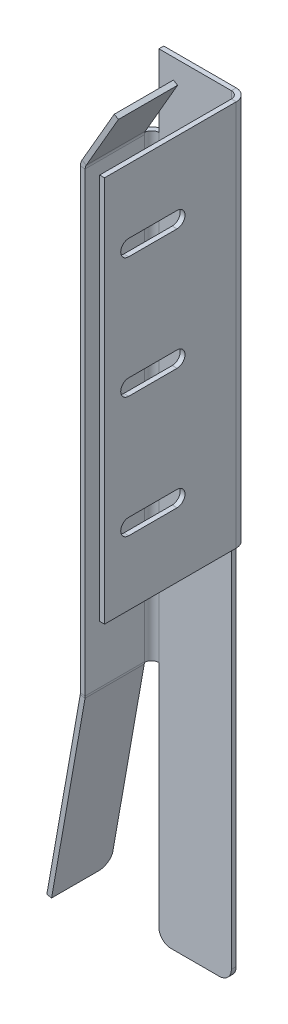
ISO-10303-21;
HEADER;
FILE_DESCRIPTION(('STEP AP214'),'2;1');
FILE_NAME('part.step','',(''),(''),'','','');
FILE_SCHEMA(('AUTOMOTIVE_DESIGN { 1 0 10303 214 1 1 1 1 }'));
ENDSEC;
DATA;
#1=APPLICATION_CONTEXT('core data for automotive mechanical design processes');
#2=APPLICATION_PROTOCOL_DEFINITION('international standard','automotive_design',2000,#1);
#3=PRODUCT_CONTEXT('',#1,'mechanical');
#4=PRODUCT('Part','Part','',(#3));
#5=PRODUCT_RELATED_PRODUCT_CATEGORY('part','',(#4));
#6=PRODUCT_DEFINITION_FORMATION('','',#4);
#7=PRODUCT_DEFINITION_CONTEXT('part definition',#1,'design');
#8=PRODUCT_DEFINITION('design','',#6,#7);
#9=PRODUCT_DEFINITION_SHAPE('','',#8);
#10=(LENGTH_UNIT() NAMED_UNIT(*) SI_UNIT(.MILLI.,.METRE.));
#11=(NAMED_UNIT(*) PLANE_ANGLE_UNIT() SI_UNIT($,.RADIAN.));
#12=(NAMED_UNIT(*) SI_UNIT($,.STERADIAN.) SOLID_ANGLE_UNIT());
#13=UNCERTAINTY_MEASURE_WITH_UNIT(LENGTH_MEASURE(1.E-05),#10,'distance_accuracy_value','');
#14=(GEOMETRIC_REPRESENTATION_CONTEXT(3) GLOBAL_UNCERTAINTY_ASSIGNED_CONTEXT((#13)) GLOBAL_UNIT_ASSIGNED_CONTEXT((#10,
#11,#12)) REPRESENTATION_CONTEXT('',''));
#15=CARTESIAN_POINT('',(0.,0.,0.));
#16=DIRECTION('',(0.,0.,1.));
#17=DIRECTION('',(1.,0.,0.));
#18=AXIS2_PLACEMENT_3D('',#15,#16,#17);
#19=CARTESIAN_POINT('',(-18.,129.196152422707,4.99999999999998));
#20=DIRECTION('',(0.,0.,1.));
#21=DIRECTION('',(1.,0.,0.));
#22=AXIS2_PLACEMENT_3D('',#19,#20,#21);
#23=PLANE('',#22);
#24=DIRECTION('',(0.,-1.,0.));
#25=VECTOR('',#24,1.);
#26=CARTESIAN_POINT('',(-20.,-60.,4.99999999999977));
#27=LINE('',#26,#25);
#28=CARTESIAN_POINT('',(-20.,129.196152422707,4.99999999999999));
#29=VERTEX_POINT('',#28);
#30=CARTESIAN_POINT('',(-20.0000000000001,130.,4.99999999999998));
#31=VERTEX_POINT('',#30);
#32=EDGE_CURVE('E425',#29,#31,#27,.F.);
#33=ORIENTED_EDGE('',*,*,#32,.F.);
#34=CARTESIAN_POINT('',(-15.,129.196152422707,4.99999999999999));
#35=DIRECTION('',(0.,0.,1.));
#36=DIRECTION('',(1.,0.,0.));
#37=AXIS2_PLACEMENT_3D('',#34,#35,#36);
#38=CIRCLE('',#37,5.00000000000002);
#39=CARTESIAN_POINT('',(-19.9349598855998,130.,4.99999999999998));
#40=VERTEX_POINT('',#39);
#41=EDGE_CURVE('E410',#29,#40,#38,.F.);
#42=ORIENTED_EDGE('',*,*,#41,.T.);
#43=DIRECTION('',(1.,0.,0.));
#44=VECTOR('',#43,1.);
#45=CARTESIAN_POINT('',(-20.,130.,4.99999999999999));
#46=LINE('',#45,#44);
#47=EDGE_CURVE('E879',#40,#31,#46,.F.);
#48=ORIENTED_EDGE('',*,*,#47,.T.);
#49=EDGE_LOOP('',(#33,#42,#48));
#50=FACE_BOUND('',#49,.T.);
#51=ADVANCED_FACE('F77',(#50),#23,.T.);
#52=CARTESIAN_POINT('',(-20.,-60.,2.00000000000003));
#53=DIRECTION('',(1.,0.,0.));
#54=DIRECTION('',(0.,0.,-1.));
#55=AXIS2_PLACEMENT_3D('',#52,#53,#54);
#56=PLANE('',#55);
#57=DIRECTION('',(0.,0.,1.));
#58=VECTOR('',#57,1.);
#59=CARTESIAN_POINT('',(-20.0000000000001,129.196152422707,29.5));
#60=LINE('',#59,#58);
#61=CARTESIAN_POINT('',(-20.0000000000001,129.196152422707,29.5));
#62=VERTEX_POINT('',#61);
#63=EDGE_CURVE('E406',#62,#29,#60,.F.);
#64=ORIENTED_EDGE('',*,*,#63,.T.);
#65=DIRECTION('',(0.,-1.,0.));
#66=VECTOR('',#65,1.);
#67=CARTESIAN_POINT('',(-20.,130.,4.99999999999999));
#68=LINE('',#67,#66);
#69=CARTESIAN_POINT('',(-20.,-59.7375340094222,5.00000000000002));
#70=VERTEX_POINT('',#69);
#71=EDGE_CURVE('E938',#70,#29,#68,.F.);
#72=ORIENTED_EDGE('',*,*,#71,.F.);
#73=DIRECTION('',(0.,0.,1.));
#74=VECTOR('',#73,1.);
#75=CARTESIAN_POINT('',(-20.0000000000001,-59.7375340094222,29.5));
#76=LINE('',#75,#74);
#77=CARTESIAN_POINT('',(-20.0000000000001,-59.7375340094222,29.5));
#78=VERTEX_POINT('',#77);
#79=EDGE_CURVE('E961',#78,#70,#76,.F.);
#80=ORIENTED_EDGE('',*,*,#79,.F.);
#81=DIRECTION('',(0.,1.,0.));
#82=VECTOR('',#81,1.);
#83=CARTESIAN_POINT('',(-20.0000000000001,-60.,29.5));
#84=LINE('',#83,#82);
#85=EDGE_CURVE('E913',#78,#62,#84,.T.);
#86=ORIENTED_EDGE('',*,*,#85,.T.);
#87=EDGE_LOOP('',(#64,#72,#80,#86));
#88=FACE_BOUND('',#87,.T.);
#89=ADVANCED_FACE('F647',(#88),#56,.F.);
#90=CARTESIAN_POINT('',(-18.,-60.,2.00000000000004));
#91=DIRECTION('',(1.,0.,0.));
#92=DIRECTION('',(0.,0.,-1.));
#93=AXIS2_PLACEMENT_3D('',#90,#91,#92);
#94=PLANE('',#93);
#95=DIRECTION('',(0.,-1.,0.));
#96=VECTOR('',#95,1.);
#97=CARTESIAN_POINT('',(-18.,130.,4.99999999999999));
#98=LINE('',#97,#96);
#99=CARTESIAN_POINT('',(-18.,129.196152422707,4.99999999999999));
#100=VERTEX_POINT('',#99);
#101=CARTESIAN_POINT('',(-18.,-59.7375340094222,5.00000000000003));
#102=VERTEX_POINT('',#101);
#103=EDGE_CURVE('E869',#100,#102,#98,.T.);
#104=ORIENTED_EDGE('',*,*,#103,.F.);
#105=DIRECTION('',(0.,0.,1.));
#106=VECTOR('',#105,1.);
#107=CARTESIAN_POINT('',(-18.0000000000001,129.196152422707,29.5));
#108=LINE('',#107,#106);
#109=CARTESIAN_POINT('',(-18.0000000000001,129.196152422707,29.5));
#110=VERTEX_POINT('',#109);
#111=EDGE_CURVE('E419',#110,#100,#108,.F.);
#112=ORIENTED_EDGE('',*,*,#111,.F.);
#113=DIRECTION('',(0.,-1.,0.));
#114=VECTOR('',#113,1.);
#115=CARTESIAN_POINT('',(-18.0000000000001,130.,29.5));
#116=LINE('',#115,#114);
#117=CARTESIAN_POINT('',(-18.0000000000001,-59.7375340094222,29.5));
#118=VERTEX_POINT('',#117);
#119=EDGE_CURVE('E960',#118,#110,#116,.F.);
#120=ORIENTED_EDGE('',*,*,#119,.F.);
#121=DIRECTION('',(0.,0.,1.));
#122=VECTOR('',#121,1.);
#123=CARTESIAN_POINT('',(-18.0000000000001,-59.7375340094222,29.5));
#124=LINE('',#123,#122);
#125=EDGE_CURVE('E976',#118,#102,#124,.F.);
#126=ORIENTED_EDGE('',*,*,#125,.T.);
#127=EDGE_LOOP('',(#104,#112,#120,#126));
#128=FACE_BOUND('',#127,.T.);
#129=ADVANCED_FACE('F653',(#128),#94,.T.);
#130=CARTESIAN_POINT('',(-20.0000000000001,130.,29.5));
#131=DIRECTION('',(0.,0.,-1.));
#132=DIRECTION('',(-1.,0.,0.));
#133=AXIS2_PLACEMENT_3D('',#130,#131,#132);
#134=PLANE('',#133);
#135=DIRECTION('',(-1.,0.,0.));
#136=VECTOR('',#135,1.);
#137=CARTESIAN_POINT('',(-18.0000000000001,129.196152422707,29.5));
#138=LINE('',#137,#136);
#139=EDGE_CURVE('E413',#110,#62,#138,.T.);
#140=ORIENTED_EDGE('',*,*,#139,.T.);
#141=ORIENTED_EDGE('',*,*,#85,.F.);
#142=DIRECTION('',(1.,0.,0.));
#143=VECTOR('',#142,1.);
#144=CARTESIAN_POINT('',(-20.0000000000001,-59.7375340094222,29.5));
#145=LINE('',#144,#143);
#146=EDGE_CURVE('E880',#78,#118,#145,.T.);
#147=ORIENTED_EDGE('',*,*,#146,.T.);
#148=ORIENTED_EDGE('',*,*,#119,.T.);
#149=EDGE_LOOP('',(#140,#141,#147,#148));
#150=FACE_BOUND('',#149,.T.);
#151=ADVANCED_FACE('F757',(#150),#134,.F.);
#152=CARTESIAN_POINT('',(15.,-160.,2.));
#153=DIRECTION('',(-1.,0.,0.));
#154=DIRECTION('',(0.,0.,1.));
#155=AXIS2_PLACEMENT_3D('',#152,#153,#154);
#156=PLANE('',#155);
#157=DIRECTION('',(0.,1.,0.));
#158=VECTOR('',#157,1.);
#159=CARTESIAN_POINT('',(15.,-160.,2.));
#160=LINE('',#159,#158);
#161=CARTESIAN_POINT('',(15.,-155.,2.));
#162=VERTEX_POINT('',#161);
#163=CARTESIAN_POINT('',(15.,0.,2.));
#164=VERTEX_POINT('',#163);
#165=EDGE_CURVE('E528',#162,#164,#160,.T.);
#166=ORIENTED_EDGE('',*,*,#165,.F.);
#167=DIRECTION('',(0.,0.,-1.));
#168=VECTOR('',#167,1.);
#169=CARTESIAN_POINT('',(15.,-155.,2.));
#170=LINE('',#169,#168);
#171=CARTESIAN_POINT('',(15.,-155.,0.));
#172=VERTEX_POINT('',#171);
#173=EDGE_CURVE('E570',#162,#172,#170,.T.);
#174=ORIENTED_EDGE('',*,*,#173,.T.);
#175=DIRECTION('',(0.,1.,0.));
#176=VECTOR('',#175,1.);
#177=CARTESIAN_POINT('',(15.,-160.,0.));
#178=LINE('',#177,#176);
#179=CARTESIAN_POINT('',(15.,0.,0.));
#180=VERTEX_POINT('',#179);
#181=EDGE_CURVE('E533',#172,#180,#178,.T.);
#182=ORIENTED_EDGE('',*,*,#181,.T.);
#183=DIRECTION('',(0.,0.,-1.));
#184=VECTOR('',#183,1.);
#185=CARTESIAN_POINT('',(15.,0.,2.));
#186=LINE('',#185,#184);
#187=EDGE_CURVE('E504',#164,#180,#186,.T.);
#188=ORIENTED_EDGE('',*,*,#187,.F.);
#189=EDGE_LOOP('',(#166,#174,#182,#188));
#190=FACE_BOUND('',#189,.T.);
#191=ADVANCED_FACE('F752',(#190),#156,.F.);
#192=CARTESIAN_POINT('',(-20.,-59.7375340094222,5.00000000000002));
#193=DIRECTION('',(0.,0.,1.));
#194=DIRECTION('',(1.,0.,0.));
#195=AXIS2_PLACEMENT_3D('',#192,#193,#194);
#196=PLANE('',#195);
#197=CARTESIAN_POINT('',(-18.,-60.,5.00000000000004));
#198=VERTEX_POINT('',#197);
#199=EDGE_CURVE('E871',#102,#198,#98,.T.);
#200=ORIENTED_EDGE('',*,*,#199,.F.);
#201=CARTESIAN_POINT('',(-23.,-59.7375340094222,5.00000000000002));
#202=DIRECTION('',(0.,0.,1.));
#203=DIRECTION('',(1.,0.,0.));
#204=AXIS2_PLACEMENT_3D('',#201,#202,#203);
#205=CIRCLE('',#204,4.99999999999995);
#206=CARTESIAN_POINT('',(-18.0068935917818,-60.,5.00000000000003));
#207=VERTEX_POINT('',#206);
#208=EDGE_CURVE('E970',#102,#207,#205,.F.);
#209=ORIENTED_EDGE('',*,*,#208,.T.);
#210=DIRECTION('',(1.,0.,0.));
#211=VECTOR('',#210,1.);
#212=CARTESIAN_POINT('',(-18.,-60.,5.00000000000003));
#213=LINE('',#212,#211);
#214=EDGE_CURVE('E873',#198,#207,#213,.F.);
#215=ORIENTED_EDGE('',*,*,#214,.F.);
#216=EDGE_LOOP('',(#200,#209,#215));
#217=FACE_BOUND('',#216,.T.);
#218=ADVANCED_FACE('F749',(#217),#196,.T.);
#219=CARTESIAN_POINT('',(-15.,-160.,2.));
#220=DIRECTION('',(1.,0.,0.));
#221=DIRECTION('',(0.,0.,-1.));
#222=AXIS2_PLACEMENT_3D('',#219,#220,#221);
#223=PLANE('',#222);
#224=DIRECTION('',(0.,0.,-1.));
#225=VECTOR('',#224,1.);
#226=CARTESIAN_POINT('',(-15.,130.,2.));
#227=LINE('',#226,#225);
#228=CARTESIAN_POINT('',(-15.,130.,2.));
#229=VERTEX_POINT('',#228);
#230=CARTESIAN_POINT('',(-15.,130.,0.));
#231=VERTEX_POINT('',#230);
#232=EDGE_CURVE('E883',#229,#231,#227,.T.);
#233=ORIENTED_EDGE('',*,*,#232,.F.);
#234=DIRECTION('',(0.,-1.,0.));
#235=VECTOR('',#234,1.);
#236=CARTESIAN_POINT('',(-15.,-160.,2.));
#237=LINE('',#236,#235);
#238=CARTESIAN_POINT('',(-15.,160.,2.));
#239=VERTEX_POINT('',#238);
#240=EDGE_CURVE('E550',#239,#229,#237,.T.);
#241=ORIENTED_EDGE('',*,*,#240,.F.);
#242=DIRECTION('',(0.,0.,-1.));
#243=VECTOR('',#242,1.);
#244=CARTESIAN_POINT('',(-15.,160.,2.));
#245=LINE('',#244,#243);
#246=CARTESIAN_POINT('',(-15.,160.,0.));
#247=VERTEX_POINT('',#246);
#248=EDGE_CURVE('E566',#239,#247,#245,.T.);
#249=ORIENTED_EDGE('',*,*,#248,.T.);
#250=DIRECTION('',(0.,-1.,0.));
#251=VECTOR('',#250,1.);
#252=CARTESIAN_POINT('',(-15.,-160.,0.));
#253=LINE('',#252,#251);
#254=EDGE_CURVE('E557',#247,#231,#253,.T.);
#255=ORIENTED_EDGE('',*,*,#254,.T.);
#256=EDGE_LOOP('',(#233,#241,#249,#255));
#257=FACE_BOUND('',#256,.T.);
#258=ADVANCED_FACE('F751',(#257),#223,.F.);
#259=CARTESIAN_POINT('',(-15.,160.,2.));
#260=DIRECTION('',(0.,-1.,0.));
#261=DIRECTION('',(0.,0.,-1.));
#262=AXIS2_PLACEMENT_3D('',#259,#260,#261);
#263=PLANE('',#262);
#264=DIRECTION('',(-1.,0.,0.));
#265=VECTOR('',#264,1.);
#266=CARTESIAN_POINT('',(-15.,160.,0.));
#267=LINE('',#266,#265);
#268=CARTESIAN_POINT('',(15.,160.,0.));
#269=VERTEX_POINT('',#268);
#270=EDGE_CURVE('E558',#269,#247,#267,.T.);
#271=ORIENTED_EDGE('',*,*,#270,.T.);
#272=ORIENTED_EDGE('',*,*,#248,.F.);
#273=DIRECTION('',(-1.,0.,0.));
#274=VECTOR('',#273,1.);
#275=CARTESIAN_POINT('',(-15.,160.,2.));
#276=LINE('',#275,#274);
#277=CARTESIAN_POINT('',(15.,160.,2.));
#278=VERTEX_POINT('',#277);
#279=EDGE_CURVE('E531',#278,#239,#276,.T.);
#280=ORIENTED_EDGE('',*,*,#279,.F.);
#281=DIRECTION('',(0.,0.,-1.));
#282=VECTOR('',#281,1.);
#283=CARTESIAN_POINT('',(15.,160.,2.));
#284=LINE('',#283,#282);
#285=EDGE_CURVE('E568',#278,#269,#284,.T.);
#286=ORIENTED_EDGE('',*,*,#285,.T.);
#287=EDGE_LOOP('',(#271,#272,#280,#286));
#288=FACE_BOUND('',#287,.T.);
#289=ADVANCED_FACE('F792',(#288),#263,.F.);
#290=CARTESIAN_POINT('',(-15.,-60.,0.));
#291=VERTEX_POINT('',#290);
#292=CARTESIAN_POINT('',(-15.,-155.,0.));
#293=VERTEX_POINT('',#292);
#294=EDGE_CURVE('E553',#291,#293,#253,.T.);
#295=ORIENTED_EDGE('',*,*,#294,.T.);
#296=DIRECTION('',(0.,0.,-1.));
#297=VECTOR('',#296,1.);
#298=CARTESIAN_POINT('',(-15.,-155.,2.));
#299=LINE('',#298,#297);
#300=CARTESIAN_POINT('',(-15.,-155.,2.));
#301=VERTEX_POINT('',#300);
#302=EDGE_CURVE('E594',#293,#301,#299,.F.);
#303=ORIENTED_EDGE('',*,*,#302,.T.);
#304=CARTESIAN_POINT('',(-15.,-60.,2.00000000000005));
#305=VERTEX_POINT('',#304);
#306=EDGE_CURVE('E542',#305,#301,#237,.T.);
#307=ORIENTED_EDGE('',*,*,#306,.F.);
#308=DIRECTION('',(0.,0.,-1.));
#309=VECTOR('',#308,1.);
#310=CARTESIAN_POINT('',(-15.,-60.,2.00000000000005));
#311=LINE('',#310,#309);
#312=EDGE_CURVE('E886',#305,#291,#311,.T.);
#313=ORIENTED_EDGE('',*,*,#312,.T.);
#314=EDGE_LOOP('',(#295,#303,#307,#313));
#315=FACE_BOUND('',#314,.T.);
#316=ADVANCED_FACE('F788',(#315),#223,.F.);
#317=CARTESIAN_POINT('',(-15.,-160.,2.));
#318=DIRECTION('',(0.,1.,0.));
#319=DIRECTION('',(0.,0.,1.));
#320=AXIS2_PLACEMENT_3D('',#317,#318,#319);
#321=PLANE('',#320);
#322=DIRECTION('',(1.,0.,0.));
#323=VECTOR('',#322,1.);
#324=CARTESIAN_POINT('',(-15.,-160.,0.));
#325=LINE('',#324,#323);
#326=CARTESIAN_POINT('',(-10.,-160.,0.));
#327=VERTEX_POINT('',#326);
#328=CARTESIAN_POINT('',(10.,-160.,0.));
#329=VERTEX_POINT('',#328);
#330=EDGE_CURVE('E532',#327,#329,#325,.T.);
#331=ORIENTED_EDGE('',*,*,#330,.T.);
#332=DIRECTION('',(0.,0.,-1.));
#333=VECTOR('',#332,1.);
#334=CARTESIAN_POINT('',(10.,-160.,2.));
#335=LINE('',#334,#333);
#336=CARTESIAN_POINT('',(10.,-160.,2.));
#337=VERTEX_POINT('',#336);
#338=EDGE_CURVE('E588',#329,#337,#335,.F.);
#339=ORIENTED_EDGE('',*,*,#338,.T.);
#340=DIRECTION('',(1.,0.,0.));
#341=VECTOR('',#340,1.);
#342=CARTESIAN_POINT('',(-15.,-160.,2.));
#343=LINE('',#342,#341);
#344=CARTESIAN_POINT('',(-10.,-160.,2.));
#345=VERTEX_POINT('',#344);
#346=EDGE_CURVE('E545',#345,#337,#343,.T.);
#347=ORIENTED_EDGE('',*,*,#346,.F.);
#348=DIRECTION('',(0.,0.,-1.));
#349=VECTOR('',#348,1.);
#350=CARTESIAN_POINT('',(-10.,-160.,2.));
#351=LINE('',#350,#349);
#352=EDGE_CURVE('E585',#345,#327,#351,.T.);
#353=ORIENTED_EDGE('',*,*,#352,.T.);
#354=EDGE_LOOP('',(#331,#339,#347,#353));
#355=FACE_BOUND('',#354,.T.);
#356=ADVANCED_FACE('F781',(#355),#321,.F.);
#357=CARTESIAN_POINT('',(15.,160.,2.));
#358=DIRECTION('',(0.,0.,-1.));
#359=DIRECTION('',(-1.,0.,0.));
#360=AXIS2_PLACEMENT_3D('',#357,#358,#359);
#361=PLANE('',#360);
#362=ORIENTED_EDGE('',*,*,#346,.T.);
#363=CARTESIAN_POINT('',(10.,-155.,2.));
#364=DIRECTION('',(0.,0.,-1.));
#365=DIRECTION('',(-1.,0.,0.));
#366=AXIS2_PLACEMENT_3D('',#363,#364,#365);
#367=CIRCLE('',#366,5.);
#368=EDGE_CURVE('E592',#337,#162,#367,.F.);
#369=ORIENTED_EDGE('',*,*,#368,.T.);
#370=ORIENTED_EDGE('',*,*,#165,.T.);
#371=DIRECTION('',(0.,1.,0.));
#372=VECTOR('',#371,1.);
#373=CARTESIAN_POINT('',(15.,160.,2.));
#374=LINE('',#373,#372);
#375=EDGE_CURVE('E498',#278,#164,#374,.F.);
#376=ORIENTED_EDGE('',*,*,#375,.F.);
#377=ORIENTED_EDGE('',*,*,#279,.T.);
#378=ORIENTED_EDGE('',*,*,#240,.T.);
#379=DIRECTION('',(0.,-1.,0.));
#380=VECTOR('',#379,1.);
#381=CARTESIAN_POINT('',(-15.,-60.,2.00000000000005));
#382=LINE('',#381,#380);
#383=EDGE_CURVE('E892',#305,#229,#382,.F.);
#384=ORIENTED_EDGE('',*,*,#383,.F.);
#385=ORIENTED_EDGE('',*,*,#306,.T.);
#386=CARTESIAN_POINT('',(-10.,-155.,2.));
#387=DIRECTION('',(0.,0.,-1.));
#388=DIRECTION('',(-1.,0.,0.));
#389=AXIS2_PLACEMENT_3D('',#386,#387,#388);
#390=CIRCLE('',#389,5.);
#391=EDGE_CURVE('E590',#301,#345,#390,.F.);
#392=ORIENTED_EDGE('',*,*,#391,.T.);
#393=EDGE_LOOP('',(#362,#369,#370,#376,#377,#378,#384,#385,#392));
#394=FACE_BOUND('',#393,.T.);
#395=ADVANCED_FACE('F778',(#394),#361,.F.);
#396=CARTESIAN_POINT('',(15.,160.,0.));
#397=DIRECTION('',(0.,0.,-1.));
#398=DIRECTION('',(-1.,0.,0.));
#399=AXIS2_PLACEMENT_3D('',#396,#397,#398);
#400=PLANE('',#399);
#401=ORIENTED_EDGE('',*,*,#181,.F.);
#402=CARTESIAN_POINT('',(10.,-155.,0.));
#403=DIRECTION('',(0.,0.,-1.));
#404=DIRECTION('',(-1.,0.,0.));
#405=AXIS2_PLACEMENT_3D('',#402,#403,#404);
#406=CIRCLE('',#405,5.);
#407=EDGE_CURVE('E581',#172,#329,#406,.T.);
#408=ORIENTED_EDGE('',*,*,#407,.T.);
#409=ORIENTED_EDGE('',*,*,#330,.F.);
#410=CARTESIAN_POINT('',(-10.,-155.,0.));
#411=DIRECTION('',(0.,0.,-1.));
#412=DIRECTION('',(-1.,0.,0.));
#413=AXIS2_PLACEMENT_3D('',#410,#411,#412);
#414=CIRCLE('',#413,5.);
#415=EDGE_CURVE('E576',#327,#293,#414,.T.);
#416=ORIENTED_EDGE('',*,*,#415,.T.);
#417=ORIENTED_EDGE('',*,*,#294,.F.);
#418=DIRECTION('',(0.,-1.,0.));
#419=VECTOR('',#418,1.);
#420=CARTESIAN_POINT('',(-15.,-60.,0.));
#421=LINE('',#420,#419);
#422=EDGE_CURVE('E896',#291,#231,#421,.F.);
#423=ORIENTED_EDGE('',*,*,#422,.T.);
#424=ORIENTED_EDGE('',*,*,#254,.F.);
#425=ORIENTED_EDGE('',*,*,#270,.F.);
#426=DIRECTION('',(0.,1.,0.));
#427=VECTOR('',#426,1.);
#428=CARTESIAN_POINT('',(15.,160.,0.));
#429=LINE('',#428,#427);
#430=EDGE_CURVE('E494',#269,#180,#429,.F.);
#431=ORIENTED_EDGE('',*,*,#430,.T.);
#432=EDGE_LOOP('',(#401,#408,#409,#416,#417,#423,#424,#425,#431));
#433=FACE_BOUND('',#432,.T.);
#434=ADVANCED_FACE('F773',(#433),#400,.T.);
#435=CARTESIAN_POINT('',(-15.,130.,5.));
#436=DIRECTION('',(0.,1.,0.));
#437=DIRECTION('',(0.,0.,1.));
#438=AXIS2_PLACEMENT_3D('',#435,#436,#437);
#439=PLANE('',#438);
#440=CARTESIAN_POINT('',(-18.,130.,4.99999999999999));
#441=VERTEX_POINT('',#440);
#442=EDGE_CURVE('E865',#441,#40,#46,.F.);
#443=ORIENTED_EDGE('',*,*,#442,.F.);
#444=CARTESIAN_POINT('',(-15.,130.,5.));
#445=DIRECTION('',(0.,-1.,0.));
#446=DIRECTION('',(0.,0.,-1.));
#447=AXIS2_PLACEMENT_3D('',#444,#445,#446);
#448=CIRCLE('',#447,3.);
#449=EDGE_CURVE('E889',#229,#441,#448,.F.);
#450=ORIENTED_EDGE('',*,*,#449,.F.);
#451=ORIENTED_EDGE('',*,*,#232,.T.);
#452=CARTESIAN_POINT('',(-15.,130.,5.));
#453=DIRECTION('',(0.,-1.,0.));
#454=DIRECTION('',(0.,0.,-1.));
#455=AXIS2_PLACEMENT_3D('',#452,#453,#454);
#456=CIRCLE('',#455,5.);
#457=EDGE_CURVE('E894',#231,#31,#456,.F.);
#458=ORIENTED_EDGE('',*,*,#457,.T.);
#459=ORIENTED_EDGE('',*,*,#47,.F.);
#460=EDGE_LOOP('',(#443,#450,#451,#458,#459));
#461=FACE_BOUND('',#460,.T.);
#462=ADVANCED_FACE('F767',(#461),#439,.T.);
#463=CARTESIAN_POINT('',(-15.,-60.,5.00000000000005));
#464=DIRECTION('',(0.,1.,0.));
#465=DIRECTION('',(0.,0.,1.));
#466=AXIS2_PLACEMENT_3D('',#463,#464,#465);
#467=PLANE('',#466);
#468=CARTESIAN_POINT('',(-15.,-60.,5.00000000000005));
#469=DIRECTION('',(0.,-1.,0.));
#470=DIRECTION('',(0.,0.,-1.));
#471=AXIS2_PLACEMENT_3D('',#468,#469,#470);
#472=CIRCLE('',#471,3.);
#473=EDGE_CURVE('E911',#198,#305,#472,.T.);
#474=ORIENTED_EDGE('',*,*,#473,.F.);
#475=ORIENTED_EDGE('',*,*,#214,.T.);
#476=CARTESIAN_POINT('',(-20.,-60.,5.00000000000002));
#477=VERTEX_POINT('',#476);
#478=EDGE_CURVE('E868',#207,#477,#213,.F.);
#479=ORIENTED_EDGE('',*,*,#478,.T.);
#480=CARTESIAN_POINT('',(-15.,-60.,5.00000000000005));
#481=DIRECTION('',(0.,-1.,0.));
#482=DIRECTION('',(0.,0.,-1.));
#483=AXIS2_PLACEMENT_3D('',#480,#481,#482);
#484=CIRCLE('',#483,5.);
#485=EDGE_CURVE('E891',#477,#291,#484,.T.);
#486=ORIENTED_EDGE('',*,*,#485,.T.);
#487=ORIENTED_EDGE('',*,*,#312,.F.);
#488=EDGE_LOOP('',(#474,#475,#479,#486,#487));
#489=FACE_BOUND('',#488,.T.);
#490=ADVANCED_FACE('F765',(#489),#467,.F.);
#491=CARTESIAN_POINT('',(-15.,-60.,5.00000000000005));
#492=DIRECTION('',(0.,-1.,0.));
#493=DIRECTION('',(-1.,0.,0.));
#494=AXIS2_PLACEMENT_3D('',#491,#492,#493);
#495=CYLINDRICAL_SURFACE('',#494,5.);
#496=ORIENTED_EDGE('',*,*,#422,.F.);
#497=ORIENTED_EDGE('',*,*,#485,.F.);
#498=EDGE_CURVE('E963',#477,#70,#68,.F.);
#499=ORIENTED_EDGE('',*,*,#498,.T.);
#500=ORIENTED_EDGE('',*,*,#71,.T.);
#501=ORIENTED_EDGE('',*,*,#32,.T.);
#502=ORIENTED_EDGE('',*,*,#457,.F.);
#503=EDGE_LOOP('',(#496,#497,#499,#500,#501,#502));
#504=FACE_BOUND('',#503,.T.);
#505=ADVANCED_FACE('F762',(#504),#495,.T.);
#506=CARTESIAN_POINT('',(-15.,-60.,5.00000000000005));
#507=DIRECTION('',(0.,-1.,0.));
#508=DIRECTION('',(-1.,0.,0.));
#509=AXIS2_PLACEMENT_3D('',#506,#507,#508);
#510=CYLINDRICAL_SURFACE('',#509,3.);
#511=ORIENTED_EDGE('',*,*,#383,.T.);
#512=ORIENTED_EDGE('',*,*,#449,.T.);
#513=EDGE_CURVE('E864',#441,#100,#98,.T.);
#514=ORIENTED_EDGE('',*,*,#513,.T.);
#515=ORIENTED_EDGE('',*,*,#103,.T.);
#516=ORIENTED_EDGE('',*,*,#199,.T.);
#517=ORIENTED_EDGE('',*,*,#473,.T.);
#518=EDGE_LOOP('',(#511,#512,#514,#515,#516,#517));
#519=FACE_BOUND('',#518,.T.);
#520=ADVANCED_FACE('F744',(#519),#510,.F.);
#521=CARTESIAN_POINT('',(-23.,-59.7375340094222,5.00000000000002));
#522=DIRECTION('',(0.,0.,-1.));
#523=DIRECTION('',(-1.,0.,0.));
#524=AXIS2_PLACEMENT_3D('',#521,#522,#523);
#525=PLANE('',#524);
#526=ORIENTED_EDGE('',*,*,#498,.F.);
#527=ORIENTED_EDGE('',*,*,#478,.F.);
#528=CARTESIAN_POINT('',(-18.075961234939,-60.6057748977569,5.00000000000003));
#529=VERTEX_POINT('',#528);
#530=EDGE_CURVE('E973',#207,#529,#205,.F.);
#531=ORIENTED_EDGE('',*,*,#530,.T.);
#532=DIRECTION('',(0.984807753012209,-0.173648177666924,0.));
#533=VECTOR('',#532,1.);
#534=CARTESIAN_POINT('',(-20.0455767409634,-60.258478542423,5.));
#535=LINE('',#534,#533);
#536=CARTESIAN_POINT('',(-20.0455767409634,-60.258478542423,5.00000000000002));
#537=VERTEX_POINT('',#536);
#538=EDGE_CURVE('E508',#537,#529,#535,.T.);
#539=ORIENTED_EDGE('',*,*,#538,.F.);
#540=CARTESIAN_POINT('',(-23.,-59.7375340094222,5.00000000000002));
#541=DIRECTION('',(0.,0.,1.));
#542=DIRECTION('',(1.,0.,0.));
#543=AXIS2_PLACEMENT_3D('',#540,#541,#542);
#544=CIRCLE('',#543,2.99999999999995);
#545=EDGE_CURVE('E983',#70,#537,#544,.F.);
#546=ORIENTED_EDGE('',*,*,#545,.F.);
#547=EDGE_LOOP('',(#526,#527,#531,#539,#546));
#548=FACE_BOUND('',#547,.T.);
#549=ADVANCED_FACE('F738',(#548),#525,.T.);
#550=CARTESIAN_POINT('',(-23.0000000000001,-59.7375340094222,29.5));
#551=DIRECTION('',(0.,0.,-1.));
#552=DIRECTION('',(-1.,0.,0.));
#553=AXIS2_PLACEMENT_3D('',#550,#551,#552);
#554=PLANE('',#553);
#555=CARTESIAN_POINT('',(-23.0000000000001,-59.7375340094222,29.5));
#556=DIRECTION('',(0.,0.,1.));
#557=DIRECTION('',(1.,0.,0.));
#558=AXIS2_PLACEMENT_3D('',#555,#556,#557);
#559=CIRCLE('',#558,2.99999999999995);
#560=CARTESIAN_POINT('',(-20.0455767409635,-60.258478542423,29.5));
#561=VERTEX_POINT('',#560);
#562=EDGE_CURVE('E986',#561,#78,#559,.T.);
#563=ORIENTED_EDGE('',*,*,#562,.F.);
#564=DIRECTION('',(0.984807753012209,-0.173648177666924,0.));
#565=VECTOR('',#564,1.);
#566=CARTESIAN_POINT('',(-20.0455767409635,-60.258478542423,29.5));
#567=LINE('',#566,#565);
#568=CARTESIAN_POINT('',(-18.075961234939,-60.6057748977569,29.5));
#569=VERTEX_POINT('',#568);
#570=EDGE_CURVE('E1012',#561,#569,#567,.T.);
#571=ORIENTED_EDGE('',*,*,#570,.T.);
#572=CARTESIAN_POINT('',(-23.0000000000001,-59.7375340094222,29.5));
#573=DIRECTION('',(0.,0.,1.));
#574=DIRECTION('',(1.,0.,0.));
#575=AXIS2_PLACEMENT_3D('',#572,#573,#574);
#576=CIRCLE('',#575,4.99999999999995);
#577=EDGE_CURVE('E980',#569,#118,#576,.T.);
#578=ORIENTED_EDGE('',*,*,#577,.T.);
#579=ORIENTED_EDGE('',*,*,#146,.F.);
#580=EDGE_LOOP('',(#563,#571,#578,#579));
#581=FACE_BOUND('',#580,.T.);
#582=ADVANCED_FACE('F736',(#581),#554,.F.);
#583=CARTESIAN_POINT('',(-23.0000000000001,-59.7375340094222,29.5));
#584=DIRECTION('',(0.,0.,1.));
#585=DIRECTION('',(0.984807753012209,-0.173648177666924,0.));
#586=AXIS2_PLACEMENT_3D('',#583,#584,#585);
#587=CYLINDRICAL_SURFACE('',#586,4.99999999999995);
#588=ORIENTED_EDGE('',*,*,#125,.F.);
#589=ORIENTED_EDGE('',*,*,#577,.F.);
#590=DIRECTION('',(0.,0.,-1.));
#591=VECTOR('',#590,1.);
#592=CARTESIAN_POINT('',(-18.075961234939,-60.6057748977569,29.5));
#593=LINE('',#592,#591);
#594=EDGE_CURVE('E1005',#569,#529,#593,.T.);
#595=ORIENTED_EDGE('',*,*,#594,.T.);
#596=ORIENTED_EDGE('',*,*,#530,.F.);
#597=ORIENTED_EDGE('',*,*,#208,.F.);
#598=EDGE_LOOP('',(#588,#589,#595,#596,#597));
#599=FACE_BOUND('',#598,.T.);
#600=ADVANCED_FACE('F733',(#599),#587,.T.);
#601=CARTESIAN_POINT('',(-23.0000000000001,-59.7375340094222,29.5));
#602=DIRECTION('',(0.,0.,1.));
#603=DIRECTION('',(0.984807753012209,-0.173648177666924,0.));
#604=AXIS2_PLACEMENT_3D('',#601,#602,#603);
#605=CYLINDRICAL_SURFACE('',#604,2.99999999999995);
#606=ORIENTED_EDGE('',*,*,#79,.T.);
#607=ORIENTED_EDGE('',*,*,#545,.T.);
#608=DIRECTION('',(0.,0.,1.));
#609=VECTOR('',#608,1.);
#610=CARTESIAN_POINT('',(-20.0455767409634,-60.258478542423,5.));
#611=LINE('',#610,#609);
#612=EDGE_CURVE('E501',#537,#561,#611,.T.);
#613=ORIENTED_EDGE('',*,*,#612,.T.);
#614=ORIENTED_EDGE('',*,*,#562,.T.);
#615=EDGE_LOOP('',(#606,#607,#613,#614));
#616=FACE_BOUND('',#615,.T.);
#617=ADVANCED_FACE('F731',(#616),#605,.F.);
#618=CARTESIAN_POINT('',(-31.9222387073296,-139.131916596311,29.5));
#619=DIRECTION('',(0.,0.,-1.));
#620=DIRECTION('',(-1.,0.,0.));
#621=AXIS2_PLACEMENT_3D('',#618,#619,#620);
#622=PLANE('',#621);
#623=ORIENTED_EDGE('',*,*,#570,.F.);
#624=DIRECTION('',(-0.173648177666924,-0.984807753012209,0.));
#625=VECTOR('',#624,1.);
#626=CARTESIAN_POINT('',(-33.891854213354,-138.784620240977,29.5));
#627=LINE('',#626,#625);
#628=CARTESIAN_POINT('',(-33.891854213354,-138.784620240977,29.5));
#629=VERTEX_POINT('',#628);
#630=EDGE_CURVE('E1004',#561,#629,#627,.T.);
#631=ORIENTED_EDGE('',*,*,#630,.T.);
#632=DIRECTION('',(-0.984807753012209,0.173648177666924,0.));
#633=VECTOR('',#632,1.);
#634=CARTESIAN_POINT('',(-31.9222387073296,-139.131916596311,29.5));
#635=LINE('',#634,#633);
#636=CARTESIAN_POINT('',(-31.9222387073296,-139.131916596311,29.5));
#637=VERTEX_POINT('',#636);
#638=EDGE_CURVE('E988',#637,#629,#635,.T.);
#639=ORIENTED_EDGE('',*,*,#638,.F.);
#640=DIRECTION('',(-0.173648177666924,-0.984807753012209,0.));
#641=VECTOR('',#640,1.);
#642=CARTESIAN_POINT('',(-31.9222387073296,-139.131916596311,29.5));
#643=LINE('',#642,#641);
#644=EDGE_CURVE('E1001',#569,#637,#643,.T.);
#645=ORIENTED_EDGE('',*,*,#644,.F.);
#646=EDGE_LOOP('',(#623,#631,#639,#645));
#647=FACE_BOUND('',#646,.T.);
#648=ADVANCED_FACE('F724',(#647),#622,.F.);
#649=CARTESIAN_POINT('',(-18.0303844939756,-60.3472963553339,5.00000000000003));
#650=DIRECTION('',(0.,0.,1.));
#651=DIRECTION('',(1.,0.,0.));
#652=AXIS2_PLACEMENT_3D('',#649,#650,#651);
#653=PLANE('',#652);
#654=DIRECTION('',(0.173648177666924,0.984807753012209,0.));
#655=VECTOR('',#654,1.);
#656=CARTESIAN_POINT('',(-18.0303844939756,-60.3472963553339,5.00000000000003));
#657=LINE('',#656,#655);
#658=CARTESIAN_POINT('',(-31.0539978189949,-134.20787783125,4.99999999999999));
#659=VERTEX_POINT('',#658);
#660=EDGE_CURVE('E991',#659,#529,#657,.T.);
#661=ORIENTED_EDGE('',*,*,#660,.F.);
#662=DIRECTION('',(-0.984807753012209,0.173648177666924,0.));
#663=VECTOR('',#662,1.);
#664=CARTESIAN_POINT('',(-31.0539978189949,-134.20787783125,4.99999999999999));
#665=LINE('',#664,#663);
#666=CARTESIAN_POINT('',(-33.0236133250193,-133.860581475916,4.99999999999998));
#667=VERTEX_POINT('',#666);
#668=EDGE_CURVE('E596',#659,#667,#665,.T.);
#669=ORIENTED_EDGE('',*,*,#668,.T.);
#670=DIRECTION('',(0.173648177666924,0.984807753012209,0.));
#671=VECTOR('',#670,1.);
#672=CARTESIAN_POINT('',(-20.,-60.,5.00000000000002));
#673=LINE('',#672,#671);
#674=EDGE_CURVE('E999',#667,#537,#673,.T.);
#675=ORIENTED_EDGE('',*,*,#674,.T.);
#676=ORIENTED_EDGE('',*,*,#538,.T.);
#677=EDGE_LOOP('',(#661,#669,#675,#676));
#678=FACE_BOUND('',#677,.T.);
#679=ADVANCED_FACE('F717',(#678),#653,.F.);
#680=CARTESIAN_POINT('',(-18.0303844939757,-60.3472963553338,29.5));
#681=DIRECTION('',(-0.984807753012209,0.173648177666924,0.));
#682=DIRECTION('',(-0.173648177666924,-0.984807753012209,0.));
#683=AXIS2_PLACEMENT_3D('',#680,#681,#682);
#684=PLANE('',#683);
#685=DIRECTION('',(0.,0.,-1.));
#686=VECTOR('',#685,1.);
#687=CARTESIAN_POINT('',(-31.9222387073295,-139.131916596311,4.99999999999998));
#688=LINE('',#687,#686);
#689=CARTESIAN_POINT('',(-31.9222387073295,-139.131916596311,9.99999999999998));
#690=VERTEX_POINT('',#689);
#691=EDGE_CURVE('E996',#637,#690,#688,.T.);
#692=ORIENTED_EDGE('',*,*,#691,.T.);
#693=CARTESIAN_POINT('',(-31.0539978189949,-134.20787783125,9.99999999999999));
#694=DIRECTION('',(-0.984807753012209,0.173648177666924,0.));
#695=DIRECTION('',(-0.173648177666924,-0.984807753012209,0.));
#696=AXIS2_PLACEMENT_3D('',#693,#694,#695);
#697=CIRCLE('',#696,5.);
#698=EDGE_CURVE('E603',#690,#659,#697,.F.);
#699=ORIENTED_EDGE('',*,*,#698,.T.);
#700=ORIENTED_EDGE('',*,*,#660,.T.);
#701=ORIENTED_EDGE('',*,*,#594,.F.);
#702=ORIENTED_EDGE('',*,*,#644,.T.);
#703=EDGE_LOOP('',(#692,#699,#700,#701,#702));
#704=FACE_BOUND('',#703,.T.);
#705=ADVANCED_FACE('F713',(#704),#684,.F.);
#706=CARTESIAN_POINT('',(-20.0000000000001,-60.,29.5));
#707=DIRECTION('',(-0.984807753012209,0.173648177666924,0.));
#708=DIRECTION('',(-0.173648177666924,-0.984807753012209,0.));
#709=AXIS2_PLACEMENT_3D('',#706,#707,#708);
#710=PLANE('',#709);
#711=ORIENTED_EDGE('',*,*,#674,.F.);
#712=CARTESIAN_POINT('',(-33.0236133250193,-133.860581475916,9.99999999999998));
#713=DIRECTION('',(-0.984807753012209,0.173648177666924,0.));
#714=DIRECTION('',(-0.173648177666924,-0.984807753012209,0.));
#715=AXIS2_PLACEMENT_3D('',#712,#713,#714);
#716=CIRCLE('',#715,5.);
#717=CARTESIAN_POINT('',(-33.8918542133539,-138.784620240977,9.99999999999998));
#718=VERTEX_POINT('',#717);
#719=EDGE_CURVE('E599',#667,#718,#716,.T.);
#720=ORIENTED_EDGE('',*,*,#719,.T.);
#721=DIRECTION('',(0.,0.,-1.));
#722=VECTOR('',#721,1.);
#723=CARTESIAN_POINT('',(-33.8918542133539,-138.784620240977,4.99999999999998));
#724=LINE('',#723,#722);
#725=EDGE_CURVE('E1002',#629,#718,#724,.T.);
#726=ORIENTED_EDGE('',*,*,#725,.F.);
#727=ORIENTED_EDGE('',*,*,#630,.F.);
#728=ORIENTED_EDGE('',*,*,#612,.F.);
#729=EDGE_LOOP('',(#711,#720,#726,#727,#728));
#730=FACE_BOUND('',#729,.T.);
#731=ADVANCED_FACE('F716',(#730),#710,.T.);
#732=CARTESIAN_POINT('',(-31.9222387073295,-139.131916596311,4.99999999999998));
#733=DIRECTION('',(0.173648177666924,0.984807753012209,0.));
#734=DIRECTION('',(-0.984807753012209,0.173648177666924,0.));
#735=AXIS2_PLACEMENT_3D('',#732,#733,#734);
#736=PLANE('',#735);
#737=ORIENTED_EDGE('',*,*,#725,.T.);
#738=DIRECTION('',(-0.984807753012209,0.173648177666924,0.));
#739=VECTOR('',#738,1.);
#740=CARTESIAN_POINT('',(-31.9222387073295,-139.131916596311,9.99999999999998));
#741=LINE('',#740,#739);
#742=EDGE_CURVE('E601',#718,#690,#741,.F.);
#743=ORIENTED_EDGE('',*,*,#742,.T.);
#744=ORIENTED_EDGE('',*,*,#691,.F.);
#745=ORIENTED_EDGE('',*,*,#638,.T.);
#746=EDGE_LOOP('',(#737,#743,#744,#745));
#747=FACE_BOUND('',#746,.T.);
#748=ADVANCED_FACE('F708',(#747),#736,.F.);
#749=CARTESIAN_POINT('',(15.,0.,5.));
#750=DIRECTION('',(0.,-1.,0.));
#751=DIRECTION('',(0.,0.,-1.));
#752=AXIS2_PLACEMENT_3D('',#749,#750,#751);
#753=PLANE('',#752);
#754=DIRECTION('',(-1.,0.,0.));
#755=VECTOR('',#754,1.);
#756=CARTESIAN_POINT('',(20.,0.,4.99999999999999));
#757=LINE('',#756,#755);
#758=CARTESIAN_POINT('',(18.,0.,4.99999999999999));
#759=VERTEX_POINT('',#758);
#760=CARTESIAN_POINT('',(20.,0.,4.99999999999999));
#761=VERTEX_POINT('',#760);
#762=EDGE_CURVE('E460',#759,#761,#757,.F.);
#763=ORIENTED_EDGE('',*,*,#762,.F.);
#764=CARTESIAN_POINT('',(15.,0.,5.));
#765=DIRECTION('',(0.,1.,0.));
#766=DIRECTION('',(0.,0.,1.));
#767=AXIS2_PLACEMENT_3D('',#764,#765,#766);
#768=CIRCLE('',#767,3.);
#769=EDGE_CURVE('E495',#164,#759,#768,.F.);
#770=ORIENTED_EDGE('',*,*,#769,.F.);
#771=ORIENTED_EDGE('',*,*,#187,.T.);
#772=CARTESIAN_POINT('',(15.,0.,5.));
#773=DIRECTION('',(0.,1.,0.));
#774=DIRECTION('',(0.,0.,1.));
#775=AXIS2_PLACEMENT_3D('',#772,#773,#774);
#776=CIRCLE('',#775,5.);
#777=EDGE_CURVE('E509',#180,#761,#776,.F.);
#778=ORIENTED_EDGE('',*,*,#777,.T.);
#779=EDGE_LOOP('',(#763,#770,#771,#778));
#780=FACE_BOUND('',#779,.T.);
#781=ADVANCED_FACE('F702',(#780),#753,.T.);
#782=CARTESIAN_POINT('',(15.,160.,5.));
#783=DIRECTION('',(0.,-1.,0.));
#784=DIRECTION('',(0.,0.,-1.));
#785=AXIS2_PLACEMENT_3D('',#782,#783,#784);
#786=PLANE('',#785);
#787=CARTESIAN_POINT('',(15.,160.,5.));
#788=DIRECTION('',(0.,1.,0.));
#789=DIRECTION('',(0.,0.,1.));
#790=AXIS2_PLACEMENT_3D('',#787,#788,#789);
#791=CIRCLE('',#790,3.);
#792=CARTESIAN_POINT('',(18.,160.,4.99999999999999));
#793=VERTEX_POINT('',#792);
#794=EDGE_CURVE('E464',#793,#278,#791,.T.);
#795=ORIENTED_EDGE('',*,*,#794,.F.);
#796=DIRECTION('',(-1.,0.,0.));
#797=VECTOR('',#796,1.);
#798=CARTESIAN_POINT('',(18.,160.,4.99999999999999));
#799=LINE('',#798,#797);
#800=CARTESIAN_POINT('',(20.,160.,4.99999999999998));
#801=VERTEX_POINT('',#800);
#802=EDGE_CURVE('E484',#793,#801,#799,.F.);
#803=ORIENTED_EDGE('',*,*,#802,.T.);
#804=CARTESIAN_POINT('',(15.,160.,5.));
#805=DIRECTION('',(0.,1.,0.));
#806=DIRECTION('',(0.,0.,1.));
#807=AXIS2_PLACEMENT_3D('',#804,#805,#806);
#808=CIRCLE('',#807,5.);
#809=EDGE_CURVE('E491',#801,#269,#808,.T.);
#810=ORIENTED_EDGE('',*,*,#809,.T.);
#811=ORIENTED_EDGE('',*,*,#285,.F.);
#812=EDGE_LOOP('',(#795,#803,#810,#811));
#813=FACE_BOUND('',#812,.T.);
#814=ADVANCED_FACE('F700',(#813),#786,.F.);
#815=CARTESIAN_POINT('',(15.,160.,5.));
#816=DIRECTION('',(0.,1.,0.));
#817=DIRECTION('',(1.,0.,0.));
#818=AXIS2_PLACEMENT_3D('',#815,#816,#817);
#819=CYLINDRICAL_SURFACE('',#818,5.);
#820=ORIENTED_EDGE('',*,*,#430,.F.);
#821=ORIENTED_EDGE('',*,*,#809,.F.);
#822=DIRECTION('',(0.,1.,0.));
#823=VECTOR('',#822,1.);
#824=CARTESIAN_POINT('',(20.,0.,4.99999999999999));
#825=LINE('',#824,#823);
#826=EDGE_CURVE('E482',#801,#761,#825,.F.);
#827=ORIENTED_EDGE('',*,*,#826,.T.);
#828=ORIENTED_EDGE('',*,*,#777,.F.);
#829=EDGE_LOOP('',(#820,#821,#827,#828));
#830=FACE_BOUND('',#829,.T.);
#831=ADVANCED_FACE('F697',(#830),#819,.T.);
#832=CARTESIAN_POINT('',(15.,160.,5.));
#833=DIRECTION('',(0.,1.,0.));
#834=DIRECTION('',(1.,0.,0.));
#835=AXIS2_PLACEMENT_3D('',#832,#833,#834);
#836=CYLINDRICAL_SURFACE('',#835,3.);
#837=ORIENTED_EDGE('',*,*,#375,.T.);
#838=ORIENTED_EDGE('',*,*,#769,.T.);
#839=DIRECTION('',(0.,1.,0.));
#840=VECTOR('',#839,1.);
#841=CARTESIAN_POINT('',(18.,0.,5.));
#842=LINE('',#841,#840);
#843=EDGE_CURVE('E487',#759,#793,#842,.T.);
#844=ORIENTED_EDGE('',*,*,#843,.T.);
#845=ORIENTED_EDGE('',*,*,#794,.T.);
#846=EDGE_LOOP('',(#837,#838,#844,#845));
#847=FACE_BOUND('',#846,.T.);
#848=ADVANCED_FACE('F695',(#847),#836,.F.);
#849=CARTESIAN_POINT('',(20.,0.,2.));
#850=DIRECTION('',(0.,1.,0.));
#851=DIRECTION('',(0.,0.,1.));
#852=AXIS2_PLACEMENT_3D('',#849,#850,#851);
#853=PLANE('',#852);
#854=ORIENTED_EDGE('',*,*,#762,.T.);
#855=DIRECTION('',(0.,0.,-1.));
#856=VECTOR('',#855,1.);
#857=CARTESIAN_POINT('',(20.0000000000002,0.,59.5));
#858=LINE('',#857,#856);
#859=CARTESIAN_POINT('',(20.0000000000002,0.,59.5));
#860=VERTEX_POINT('',#859);
#861=EDGE_CURVE('E472',#860,#761,#858,.T.);
#862=ORIENTED_EDGE('',*,*,#861,.F.);
#863=DIRECTION('',(-1.,0.,0.));
#864=VECTOR('',#863,1.);
#865=CARTESIAN_POINT('',(20.0000000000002,0.,59.5));
#866=LINE('',#865,#864);
#867=CARTESIAN_POINT('',(18.0000000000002,0.,59.5));
#868=VERTEX_POINT('',#867);
#869=EDGE_CURVE('E465',#860,#868,#866,.T.);
#870=ORIENTED_EDGE('',*,*,#869,.T.);
#871=DIRECTION('',(0.,0.,1.));
#872=VECTOR('',#871,1.);
#873=CARTESIAN_POINT('',(18.,0.,2.00000000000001));
#874=LINE('',#873,#872);
#875=EDGE_CURVE('E479',#868,#759,#874,.F.);
#876=ORIENTED_EDGE('',*,*,#875,.T.);
#877=EDGE_LOOP('',(#854,#862,#870,#876));
#878=FACE_BOUND('',#877,.T.);
#879=ADVANCED_FACE('F691',(#878),#853,.F.);
#880=CARTESIAN_POINT('',(20.0000000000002,160.,59.5));
#881=DIRECTION('',(0.,-1.,0.));
#882=DIRECTION('',(0.,0.,-1.));
#883=AXIS2_PLACEMENT_3D('',#880,#881,#882);
#884=PLANE('',#883);
#885=ORIENTED_EDGE('',*,*,#802,.F.);
#886=DIRECTION('',(0.,0.,-1.));
#887=VECTOR('',#886,1.);
#888=CARTESIAN_POINT('',(18.0000000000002,160.,59.5));
#889=LINE('',#888,#887);
#890=CARTESIAN_POINT('',(18.0000000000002,160.,59.5));
#891=VERTEX_POINT('',#890);
#892=EDGE_CURVE('E477',#793,#891,#889,.F.);
#893=ORIENTED_EDGE('',*,*,#892,.T.);
#894=DIRECTION('',(-1.,0.,0.));
#895=VECTOR('',#894,1.);
#896=CARTESIAN_POINT('',(20.0000000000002,160.,59.5));
#897=LINE('',#896,#895);
#898=CARTESIAN_POINT('',(20.0000000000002,160.,59.5));
#899=VERTEX_POINT('',#898);
#900=EDGE_CURVE('E461',#899,#891,#897,.T.);
#901=ORIENTED_EDGE('',*,*,#900,.F.);
#902=DIRECTION('',(0.,0.,1.));
#903=VECTOR('',#902,1.);
#904=CARTESIAN_POINT('',(20.0000000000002,160.,59.5));
#905=LINE('',#904,#903);
#906=EDGE_CURVE('E470',#801,#899,#905,.T.);
#907=ORIENTED_EDGE('',*,*,#906,.F.);
#908=EDGE_LOOP('',(#885,#893,#901,#907));
#909=FACE_BOUND('',#908,.T.);
#910=ADVANCED_FACE('F682',(#909),#884,.F.);
#911=CARTESIAN_POINT('',(20.0000000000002,0.,59.5));
#912=DIRECTION('',(-1.,0.,0.));
#913=DIRECTION('',(0.,0.,1.));
#914=AXIS2_PLACEMENT_3D('',#911,#912,#913);
#915=PLANE('',#914);
#916=CARTESIAN_POINT('',(20.0000000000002,80.,49.5));
#917=DIRECTION('',(1.,0.,0.));
#918=DIRECTION('',(0.,0.,-1.));
#919=AXIS2_PLACEMENT_3D('',#916,#917,#918);
#920=CIRCLE('',#919,3.3);
#921=CARTESIAN_POINT('',(20.0000000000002,83.3,49.5));
#922=VERTEX_POINT('',#921);
#923=CARTESIAN_POINT('',(20.0000000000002,76.7,49.5));
#924=VERTEX_POINT('',#923);
#925=EDGE_CURVE('E366',#922,#924,#920,.T.);
#926=ORIENTED_EDGE('',*,*,#925,.F.);
#927=DIRECTION('',(0.,0.,1.));
#928=VECTOR('',#927,1.);
#929=CARTESIAN_POINT('',(20.0000000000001,83.3,29.5));
#930=LINE('',#929,#928);
#931=CARTESIAN_POINT('',(20.0000000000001,83.3,29.5));
#932=VERTEX_POINT('',#931);
#933=EDGE_CURVE('E357',#932,#922,#930,.T.);
#934=ORIENTED_EDGE('',*,*,#933,.F.);
#935=CARTESIAN_POINT('',(20.0000000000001,80.,29.5));
#936=DIRECTION('',(1.,0.,0.));
#937=DIRECTION('',(0.,0.,-1.));
#938=AXIS2_PLACEMENT_3D('',#935,#936,#937);
#939=CIRCLE('',#938,3.3);
#940=CARTESIAN_POINT('',(20.0000000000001,76.7,29.5));
#941=VERTEX_POINT('',#940);
#942=EDGE_CURVE('E342',#941,#932,#939,.T.);
#943=ORIENTED_EDGE('',*,*,#942,.F.);
#944=DIRECTION('',(0.,0.,-1.));
#945=VECTOR('',#944,1.);
#946=CARTESIAN_POINT('',(20.0000000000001,76.7,29.5));
#947=LINE('',#946,#945);
#948=EDGE_CURVE('E1497',#924,#941,#947,.T.);
#949=ORIENTED_EDGE('',*,*,#948,.F.);
#950=EDGE_LOOP('',(#926,#934,#943,#949));
#951=FACE_BOUND('',#950,.T.);
#952=CARTESIAN_POINT('',(20.0000000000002,130.,49.5));
#953=DIRECTION('',(1.,0.,0.));
#954=DIRECTION('',(0.,0.,-1.));
#955=AXIS2_PLACEMENT_3D('',#952,#953,#954);
#956=CIRCLE('',#955,3.3);
#957=CARTESIAN_POINT('',(20.0000000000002,133.3,49.5));
#958=VERTEX_POINT('',#957);
#959=CARTESIAN_POINT('',(20.0000000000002,126.7,49.5));
#960=VERTEX_POINT('',#959);
#961=EDGE_CURVE('E443',#958,#960,#956,.T.);
#962=ORIENTED_EDGE('',*,*,#961,.F.);
#963=DIRECTION('',(0.,0.,1.));
#964=VECTOR('',#963,1.);
#965=CARTESIAN_POINT('',(20.0000000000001,133.3,29.5));
#966=LINE('',#965,#964);
#967=CARTESIAN_POINT('',(20.0000000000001,133.3,29.5));
#968=VERTEX_POINT('',#967);
#969=EDGE_CURVE('E440',#968,#958,#966,.T.);
#970=ORIENTED_EDGE('',*,*,#969,.F.);
#971=CARTESIAN_POINT('',(20.0000000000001,130.,29.5));
#972=DIRECTION('',(1.,0.,0.));
#973=DIRECTION('',(0.,0.,-1.));
#974=AXIS2_PLACEMENT_3D('',#971,#972,#973);
#975=CIRCLE('',#974,3.3);
#976=CARTESIAN_POINT('',(20.0000000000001,126.7,29.5));
#977=VERTEX_POINT('',#976);
#978=EDGE_CURVE('E437',#977,#968,#975,.T.);
#979=ORIENTED_EDGE('',*,*,#978,.F.);
#980=DIRECTION('',(0.,0.,-1.));
#981=VECTOR('',#980,1.);
#982=CARTESIAN_POINT('',(20.0000000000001,126.7,29.5));
#983=LINE('',#982,#981);
#984=EDGE_CURVE('E446',#960,#977,#983,.T.);
#985=ORIENTED_EDGE('',*,*,#984,.F.);
#986=EDGE_LOOP('',(#962,#970,#979,#985));
#987=FACE_BOUND('',#986,.T.);
#988=ORIENTED_EDGE('',*,*,#826,.F.);
#989=ORIENTED_EDGE('',*,*,#906,.T.);
#990=DIRECTION('',(0.,-1.,0.));
#991=VECTOR('',#990,1.);
#992=CARTESIAN_POINT('',(20.0000000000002,0.,59.5));
#993=LINE('',#992,#991);
#994=EDGE_CURVE('E468',#899,#860,#993,.T.);
#995=ORIENTED_EDGE('',*,*,#994,.T.);
#996=ORIENTED_EDGE('',*,*,#861,.T.);
#997=EDGE_LOOP('',(#988,#989,#995,#996));
#998=FACE_BOUND('',#997,.T.);
#999=DIRECTION('',(0.,0.,1.));
#1000=VECTOR('',#999,1.);
#1001=CARTESIAN_POINT('',(20.0000000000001,33.3,29.5));
#1002=LINE('',#1001,#1000);
#1003=CARTESIAN_POINT('',(20.0000000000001,33.3,29.5));
#1004=VERTEX_POINT('',#1003);
#1005=CARTESIAN_POINT('',(20.0000000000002,33.3,49.5));
#1006=VERTEX_POINT('',#1005);
#1007=EDGE_CURVE('E605',#1004,#1006,#1002,.T.);
#1008=ORIENTED_EDGE('',*,*,#1007,.F.);
#1009=CARTESIAN_POINT('',(20.0000000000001,30.,29.5));
#1010=DIRECTION('',(1.,0.,0.));
#1011=DIRECTION('',(0.,0.,-1.));
#1012=AXIS2_PLACEMENT_3D('',#1009,#1010,#1011);
#1013=CIRCLE('',#1012,3.3);
#1014=CARTESIAN_POINT('',(20.0000000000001,26.7,29.5));
#1015=VERTEX_POINT('',#1014);
#1016=EDGE_CURVE('E607',#1015,#1004,#1013,.T.);
#1017=ORIENTED_EDGE('',*,*,#1016,.F.);
#1018=DIRECTION('',(0.,0.,-1.));
#1019=VECTOR('',#1018,1.);
#1020=CARTESIAN_POINT('',(20.0000000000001,26.7,29.5));
#1021=LINE('',#1020,#1019);
#1022=CARTESIAN_POINT('',(20.0000000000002,26.7,49.5));
#1023=VERTEX_POINT('',#1022);
#1024=EDGE_CURVE('E610',#1023,#1015,#1021,.T.);
#1025=ORIENTED_EDGE('',*,*,#1024,.F.);
#1026=CARTESIAN_POINT('',(20.0000000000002,30.,49.5));
#1027=DIRECTION('',(1.,0.,0.));
#1028=DIRECTION('',(0.,0.,-1.));
#1029=AXIS2_PLACEMENT_3D('',#1026,#1027,#1028);
#1030=CIRCLE('',#1029,3.3);
#1031=EDGE_CURVE('E613',#1006,#1023,#1030,.T.);
#1032=ORIENTED_EDGE('',*,*,#1031,.F.);
#1033=EDGE_LOOP('',(#1008,#1017,#1025,#1032));
#1034=FACE_BOUND('',#1033,.T.);
#1035=ADVANCED_FACE('F363',(#951,#987,#998,#1034),#915,.F.);
#1036=CARTESIAN_POINT('',(18.0000000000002,0.,59.5));
#1037=DIRECTION('',(-1.,0.,0.));
#1038=DIRECTION('',(0.,0.,1.));
#1039=AXIS2_PLACEMENT_3D('',#1036,#1037,#1038);
#1040=PLANE('',#1039);
#1041=DIRECTION('',(0.,0.,1.));
#1042=VECTOR('',#1041,1.);
#1043=CARTESIAN_POINT('',(18.0000000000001,83.3,29.5));
#1044=LINE('',#1043,#1042);
#1045=CARTESIAN_POINT('',(18.0000000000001,83.3,29.5));
#1046=VERTEX_POINT('',#1045);
#1047=CARTESIAN_POINT('',(18.0000000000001,83.3,49.5));
#1048=VERTEX_POINT('',#1047);
#1049=EDGE_CURVE('E360',#1046,#1048,#1044,.T.);
#1050=ORIENTED_EDGE('',*,*,#1049,.T.);
#1051=CARTESIAN_POINT('',(18.0000000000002,80.,49.5));
#1052=DIRECTION('',(-1.,0.,0.));
#1053=DIRECTION('',(0.,0.,1.));
#1054=AXIS2_PLACEMENT_3D('',#1051,#1052,#1053);
#1055=CIRCLE('',#1054,3.3);
#1056=CARTESIAN_POINT('',(18.0000000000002,76.7,49.5000000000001));
#1057=VERTEX_POINT('',#1056);
#1058=EDGE_CURVE('E367',#1048,#1057,#1055,.F.);
#1059=ORIENTED_EDGE('',*,*,#1058,.T.);
#1060=DIRECTION('',(0.,0.,-1.));
#1061=VECTOR('',#1060,1.);
#1062=CARTESIAN_POINT('',(18.0000000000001,76.7,29.5));
#1063=LINE('',#1062,#1061);
#1064=CARTESIAN_POINT('',(18.0000000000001,76.7,29.5));
#1065=VERTEX_POINT('',#1064);
#1066=EDGE_CURVE('E1494',#1057,#1065,#1063,.T.);
#1067=ORIENTED_EDGE('',*,*,#1066,.T.);
#1068=CARTESIAN_POINT('',(18.0000000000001,80.,29.5));
#1069=DIRECTION('',(-1.,0.,0.));
#1070=DIRECTION('',(0.,0.,1.));
#1071=AXIS2_PLACEMENT_3D('',#1068,#1069,#1070);
#1072=CIRCLE('',#1071,3.3);
#1073=EDGE_CURVE('E352',#1065,#1046,#1072,.F.);
#1074=ORIENTED_EDGE('',*,*,#1073,.T.);
#1075=EDGE_LOOP('',(#1050,#1059,#1067,#1074));
#1076=FACE_BOUND('',#1075,.T.);
#1077=DIRECTION('',(0.,0.,1.));
#1078=VECTOR('',#1077,1.);
#1079=CARTESIAN_POINT('',(18.0000000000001,133.3,29.5));
#1080=LINE('',#1079,#1078);
#1081=CARTESIAN_POINT('',(18.0000000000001,133.3,29.5));
#1082=VERTEX_POINT('',#1081);
#1083=CARTESIAN_POINT('',(18.0000000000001,133.3,49.5));
#1084=VERTEX_POINT('',#1083);
#1085=EDGE_CURVE('E452',#1082,#1084,#1080,.T.);
#1086=ORIENTED_EDGE('',*,*,#1085,.T.);
#1087=CARTESIAN_POINT('',(18.0000000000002,130.,49.5));
#1088=DIRECTION('',(-1.,0.,0.));
#1089=DIRECTION('',(0.,0.,1.));
#1090=AXIS2_PLACEMENT_3D('',#1087,#1088,#1089);
#1091=CIRCLE('',#1090,3.3);
#1092=CARTESIAN_POINT('',(18.0000000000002,126.7,49.5000000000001));
#1093=VERTEX_POINT('',#1092);
#1094=EDGE_CURVE('E428',#1084,#1093,#1091,.F.);
#1095=ORIENTED_EDGE('',*,*,#1094,.T.);
#1096=DIRECTION('',(0.,0.,-1.));
#1097=VECTOR('',#1096,1.);
#1098=CARTESIAN_POINT('',(18.0000000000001,126.7,29.5));
#1099=LINE('',#1098,#1097);
#1100=CARTESIAN_POINT('',(18.0000000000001,126.7,29.5));
#1101=VERTEX_POINT('',#1100);
#1102=EDGE_CURVE('E431',#1093,#1101,#1099,.T.);
#1103=ORIENTED_EDGE('',*,*,#1102,.T.);
#1104=CARTESIAN_POINT('',(18.0000000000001,130.,29.5));
#1105=DIRECTION('',(-1.,0.,0.));
#1106=DIRECTION('',(0.,0.,1.));
#1107=AXIS2_PLACEMENT_3D('',#1104,#1105,#1106);
#1108=CIRCLE('',#1107,3.3);
#1109=EDGE_CURVE('E434',#1101,#1082,#1108,.F.);
#1110=ORIENTED_EDGE('',*,*,#1109,.T.);
#1111=EDGE_LOOP('',(#1086,#1095,#1103,#1110));
#1112=FACE_BOUND('',#1111,.T.);
#1113=ORIENTED_EDGE('',*,*,#892,.F.);
#1114=ORIENTED_EDGE('',*,*,#843,.F.);
#1115=ORIENTED_EDGE('',*,*,#875,.F.);
#1116=DIRECTION('',(0.,1.,0.));
#1117=VECTOR('',#1116,1.);
#1118=CARTESIAN_POINT('',(18.0000000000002,0.,59.5));
#1119=LINE('',#1118,#1117);
#1120=EDGE_CURVE('E475',#891,#868,#1119,.F.);
#1121=ORIENTED_EDGE('',*,*,#1120,.F.);
#1122=EDGE_LOOP('',(#1113,#1114,#1115,#1121));
#1123=FACE_BOUND('',#1122,.T.);
#1124=DIRECTION('',(0.,0.,1.));
#1125=VECTOR('',#1124,1.);
#1126=CARTESIAN_POINT('',(18.0000000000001,33.3,29.5));
#1127=LINE('',#1126,#1125);
#1128=CARTESIAN_POINT('',(18.0000000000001,33.3,29.5));
#1129=VERTEX_POINT('',#1128);
#1130=CARTESIAN_POINT('',(18.0000000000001,33.3,49.5));
#1131=VERTEX_POINT('',#1130);
#1132=EDGE_CURVE('E92',#1129,#1131,#1127,.T.);
#1133=ORIENTED_EDGE('',*,*,#1132,.T.);
#1134=CARTESIAN_POINT('',(18.0000000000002,30.,49.5));
#1135=DIRECTION('',(-1.,0.,0.));
#1136=DIRECTION('',(0.,0.,1.));
#1137=AXIS2_PLACEMENT_3D('',#1134,#1135,#1136);
#1138=CIRCLE('',#1137,3.3);
#1139=CARTESIAN_POINT('',(18.0000000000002,26.7,49.5000000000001));
#1140=VERTEX_POINT('',#1139);
#1141=EDGE_CURVE('E617',#1131,#1140,#1138,.F.);
#1142=ORIENTED_EDGE('',*,*,#1141,.T.);
#1143=DIRECTION('',(0.,0.,-1.));
#1144=VECTOR('',#1143,1.);
#1145=CARTESIAN_POINT('',(18.0000000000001,26.7,29.5));
#1146=LINE('',#1145,#1144);
#1147=CARTESIAN_POINT('',(18.0000000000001,26.7,29.5));
#1148=VERTEX_POINT('',#1147);
#1149=EDGE_CURVE('E99',#1140,#1148,#1146,.T.);
#1150=ORIENTED_EDGE('',*,*,#1149,.T.);
#1151=CARTESIAN_POINT('',(18.0000000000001,30.,29.5));
#1152=DIRECTION('',(-1.,0.,0.));
#1153=DIRECTION('',(0.,0.,1.));
#1154=AXIS2_PLACEMENT_3D('',#1151,#1152,#1153);
#1155=CIRCLE('',#1154,3.3);
#1156=EDGE_CURVE('E620',#1148,#1129,#1155,.F.);
#1157=ORIENTED_EDGE('',*,*,#1156,.T.);
#1158=EDGE_LOOP('',(#1133,#1142,#1150,#1157));
#1159=FACE_BOUND('',#1158,.T.);
#1160=ADVANCED_FACE('F681',(#1076,#1112,#1123,#1159),#1040,.T.);
#1161=CARTESIAN_POINT('',(20.0000000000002,0.,59.5));
#1162=DIRECTION('',(0.,0.,-1.));
#1163=DIRECTION('',(-1.,0.,0.));
#1164=AXIS2_PLACEMENT_3D('',#1161,#1162,#1163);
#1165=PLANE('',#1164);
#1166=ORIENTED_EDGE('',*,*,#1120,.T.);
#1167=ORIENTED_EDGE('',*,*,#869,.F.);
#1168=ORIENTED_EDGE('',*,*,#994,.F.);
#1169=ORIENTED_EDGE('',*,*,#900,.T.);
#1170=EDGE_LOOP('',(#1166,#1167,#1168,#1169));
#1171=FACE_BOUND('',#1170,.T.);
#1172=ADVANCED_FACE('F673',(#1171),#1165,.F.);
#1173=CARTESIAN_POINT('',(-33.8928542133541,133.3,29.5000000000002));
#1174=DIRECTION('',(0.,1.,0.));
#1175=DIRECTION('',(0.,0.,1.));
#1176=AXIS2_PLACEMENT_3D('',#1173,#1174,#1175);
#1177=PLANE('',#1176);
#1178=DIRECTION('',(1.,0.,0.));
#1179=VECTOR('',#1178,1.);
#1180=CARTESIAN_POINT('',(-33.8928542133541,133.3,29.5000000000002));
#1181=LINE('',#1180,#1179);
#1182=EDGE_CURVE('E448',#1082,#968,#1181,.T.);
#1183=ORIENTED_EDGE('',*,*,#1182,.T.);
#1184=ORIENTED_EDGE('',*,*,#969,.T.);
#1185=DIRECTION('',(1.,0.,0.));
#1186=VECTOR('',#1185,1.);
#1187=CARTESIAN_POINT('',(-33.892854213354,133.3,49.5000000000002));
#1188=LINE('',#1187,#1186);
#1189=EDGE_CURVE('E455',#1084,#958,#1188,.T.);
#1190=ORIENTED_EDGE('',*,*,#1189,.F.);
#1191=ORIENTED_EDGE('',*,*,#1085,.F.);
#1192=EDGE_LOOP('',(#1183,#1184,#1190,#1191));
#1193=FACE_BOUND('',#1192,.T.);
#1194=ADVANCED_FACE('F669',(#1193),#1177,.F.);
#1195=CARTESIAN_POINT('',(-33.892854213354,130.,49.5000000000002));
#1196=DIRECTION('',(1.,0.,0.));
#1197=DIRECTION('',(0.,0.,-1.));
#1198=AXIS2_PLACEMENT_3D('',#1195,#1196,#1197);
#1199=CYLINDRICAL_SURFACE('',#1198,3.3);
#1200=ORIENTED_EDGE('',*,*,#1189,.T.);
#1201=ORIENTED_EDGE('',*,*,#961,.T.);
#1202=DIRECTION('',(1.,0.,0.));
#1203=VECTOR('',#1202,1.);
#1204=CARTESIAN_POINT('',(-33.892854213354,126.7,49.5000000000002));
#1205=LINE('',#1204,#1203);
#1206=EDGE_CURVE('E453',#1093,#960,#1205,.T.);
#1207=ORIENTED_EDGE('',*,*,#1206,.F.);
#1208=ORIENTED_EDGE('',*,*,#1094,.F.);
#1209=EDGE_LOOP('',(#1200,#1201,#1207,#1208));
#1210=FACE_BOUND('',#1209,.T.);
#1211=ADVANCED_FACE('F665',(#1210),#1199,.F.);
#1212=CARTESIAN_POINT('',(-33.8928542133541,126.7,29.5000000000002));
#1213=DIRECTION('',(0.,-1.,0.));
#1214=DIRECTION('',(0.,0.,-1.));
#1215=AXIS2_PLACEMENT_3D('',#1212,#1213,#1214);
#1216=PLANE('',#1215);
#1217=ORIENTED_EDGE('',*,*,#1206,.T.);
#1218=ORIENTED_EDGE('',*,*,#984,.T.);
#1219=DIRECTION('',(1.,0.,0.));
#1220=VECTOR('',#1219,1.);
#1221=CARTESIAN_POINT('',(-33.8928542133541,126.7,29.5000000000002));
#1222=LINE('',#1221,#1220);
#1223=EDGE_CURVE('E449',#1101,#977,#1222,.T.);
#1224=ORIENTED_EDGE('',*,*,#1223,.F.);
#1225=ORIENTED_EDGE('',*,*,#1102,.F.);
#1226=EDGE_LOOP('',(#1217,#1218,#1224,#1225));
#1227=FACE_BOUND('',#1226,.T.);
#1228=ADVANCED_FACE('F661',(#1227),#1216,.F.);
#1229=CARTESIAN_POINT('',(-33.8928542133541,130.,29.5000000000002));
#1230=DIRECTION('',(1.,0.,0.));
#1231=DIRECTION('',(0.,0.,-1.));
#1232=AXIS2_PLACEMENT_3D('',#1229,#1230,#1231);
#1233=CYLINDRICAL_SURFACE('',#1232,3.3);
#1234=ORIENTED_EDGE('',*,*,#1223,.T.);
#1235=ORIENTED_EDGE('',*,*,#978,.T.);
#1236=ORIENTED_EDGE('',*,*,#1182,.F.);
#1237=ORIENTED_EDGE('',*,*,#1109,.F.);
#1238=EDGE_LOOP('',(#1234,#1235,#1236,#1237));
#1239=FACE_BOUND('',#1238,.T.);
#1240=ADVANCED_FACE('F664',(#1239),#1233,.F.);
#1241=CARTESIAN_POINT('',(-15.,129.196152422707,4.99999999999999));
#1242=DIRECTION('',(0.,0.,-1.));
#1243=DIRECTION('',(-1.,0.,0.));
#1244=AXIS2_PLACEMENT_3D('',#1241,#1242,#1243);
#1245=PLANE('',#1244);
#1246=ORIENTED_EDGE('',*,*,#513,.F.);
#1247=ORIENTED_EDGE('',*,*,#442,.T.);
#1248=CARTESIAN_POINT('',(-19.3301270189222,131.696152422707,4.99999999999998));
#1249=VERTEX_POINT('',#1248);
#1250=EDGE_CURVE('E408',#40,#1249,#38,.F.);
#1251=ORIENTED_EDGE('',*,*,#1250,.T.);
#1252=DIRECTION('',(-0.866025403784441,0.499999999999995,0.));
#1253=VECTOR('',#1252,1.);
#1254=CARTESIAN_POINT('',(-17.5980762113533,130.696152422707,5.00000000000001));
#1255=LINE('',#1254,#1253);
#1256=CARTESIAN_POINT('',(-17.5980762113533,130.696152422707,4.99999999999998));
#1257=VERTEX_POINT('',#1256);
#1258=EDGE_CURVE('E369',#1257,#1249,#1255,.T.);
#1259=ORIENTED_EDGE('',*,*,#1258,.F.);
#1260=CARTESIAN_POINT('',(-15.,129.196152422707,4.99999999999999));
#1261=DIRECTION('',(0.,0.,1.));
#1262=DIRECTION('',(1.,0.,0.));
#1263=AXIS2_PLACEMENT_3D('',#1260,#1261,#1262);
#1264=CIRCLE('',#1263,3.00000000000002);
#1265=EDGE_CURVE('E416',#100,#1257,#1264,.F.);
#1266=ORIENTED_EDGE('',*,*,#1265,.F.);
#1267=EDGE_LOOP('',(#1246,#1247,#1251,#1259,#1266));
#1268=FACE_BOUND('',#1267,.T.);
#1269=ADVANCED_FACE('F677',(#1268),#1245,.T.);
#1270=CARTESIAN_POINT('',(-15.,129.196152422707,29.5));
#1271=DIRECTION('',(0.,0.,-1.));
#1272=DIRECTION('',(-1.,0.,0.));
#1273=AXIS2_PLACEMENT_3D('',#1270,#1271,#1272);
#1274=PLANE('',#1273);
#1275=CARTESIAN_POINT('',(-15.,129.196152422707,29.5));
#1276=DIRECTION('',(0.,0.,1.));
#1277=DIRECTION('',(1.,0.,0.));
#1278=AXIS2_PLACEMENT_3D('',#1275,#1276,#1277);
#1279=CIRCLE('',#1278,3.00000000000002);
#1280=CARTESIAN_POINT('',(-17.5980762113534,130.696152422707,29.5));
#1281=VERTEX_POINT('',#1280);
#1282=EDGE_CURVE('E405',#1281,#110,#1279,.T.);
#1283=ORIENTED_EDGE('',*,*,#1282,.F.);
#1284=DIRECTION('',(-0.866025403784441,0.499999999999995,0.));
#1285=VECTOR('',#1284,1.);
#1286=CARTESIAN_POINT('',(-17.5980762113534,130.696152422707,29.5));
#1287=LINE('',#1286,#1285);
#1288=CARTESIAN_POINT('',(-19.3301270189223,131.696152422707,29.5));
#1289=VERTEX_POINT('',#1288);
#1290=EDGE_CURVE('E377',#1281,#1289,#1287,.T.);
#1291=ORIENTED_EDGE('',*,*,#1290,.T.);
#1292=CARTESIAN_POINT('',(-15.,129.196152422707,29.5));
#1293=DIRECTION('',(0.,0.,1.));
#1294=DIRECTION('',(1.,0.,0.));
#1295=AXIS2_PLACEMENT_3D('',#1292,#1293,#1294);
#1296=CIRCLE('',#1295,5.00000000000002);
#1297=EDGE_CURVE('E409',#1289,#62,#1296,.T.);
#1298=ORIENTED_EDGE('',*,*,#1297,.T.);
#1299=ORIENTED_EDGE('',*,*,#139,.F.);
#1300=EDGE_LOOP('',(#1283,#1291,#1298,#1299));
#1301=FACE_BOUND('',#1300,.T.);
#1302=ADVANCED_FACE('F659',(#1301),#1274,.F.);
#1303=CARTESIAN_POINT('',(-15.,129.196152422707,29.5));
#1304=DIRECTION('',(0.,0.,1.));
#1305=DIRECTION('',(-0.866025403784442,0.499999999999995,0.));
#1306=AXIS2_PLACEMENT_3D('',#1303,#1304,#1305);
#1307=CYLINDRICAL_SURFACE('',#1306,5.00000000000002);
#1308=ORIENTED_EDGE('',*,*,#63,.F.);
#1309=ORIENTED_EDGE('',*,*,#1297,.F.);
#1310=DIRECTION('',(0.,0.,-1.));
#1311=VECTOR('',#1310,1.);
#1312=CARTESIAN_POINT('',(-19.3301270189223,131.696152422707,29.5));
#1313=LINE('',#1312,#1311);
#1314=EDGE_CURVE('E380',#1289,#1249,#1313,.T.);
#1315=ORIENTED_EDGE('',*,*,#1314,.T.);
#1316=ORIENTED_EDGE('',*,*,#1250,.F.);
#1317=ORIENTED_EDGE('',*,*,#41,.F.);
#1318=EDGE_LOOP('',(#1308,#1309,#1315,#1316,#1317));
#1319=FACE_BOUND('',#1318,.T.);
#1320=ADVANCED_FACE('F848',(#1319),#1307,.T.);
#1321=CARTESIAN_POINT('',(-15.,129.196152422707,29.5));
#1322=DIRECTION('',(0.,0.,1.));
#1323=DIRECTION('',(-0.866025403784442,0.499999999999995,0.));
#1324=AXIS2_PLACEMENT_3D('',#1321,#1322,#1323);
#1325=CYLINDRICAL_SURFACE('',#1324,3.00000000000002);
#1326=ORIENTED_EDGE('',*,*,#111,.T.);
#1327=ORIENTED_EDGE('',*,*,#1265,.T.);
#1328=DIRECTION('',(0.,0.,1.));
#1329=VECTOR('',#1328,1.);
#1330=CARTESIAN_POINT('',(-17.5980762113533,130.696152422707,5.00000000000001));
#1331=LINE('',#1330,#1329);
#1332=EDGE_CURVE('E375',#1257,#1281,#1331,.T.);
#1333=ORIENTED_EDGE('',*,*,#1332,.T.);
#1334=ORIENTED_EDGE('',*,*,#1282,.T.);
#1335=EDGE_LOOP('',(#1326,#1327,#1333,#1334));
#1336=FACE_BOUND('',#1335,.T.);
#1337=ADVANCED_FACE('F846',(#1336),#1325,.F.);
#1338=CARTESIAN_POINT('',(-5.99166975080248,154.799038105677,29.5));
#1339=DIRECTION('',(0.,0.,-1.));
#1340=DIRECTION('',(-1.,0.,0.));
#1341=AXIS2_PLACEMENT_3D('',#1338,#1339,#1340);
#1342=PLANE('',#1341);
#1343=ORIENTED_EDGE('',*,*,#1290,.F.);
#1344=DIRECTION('',(0.499999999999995,0.866025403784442,0.));
#1345=VECTOR('',#1344,1.);
#1346=CARTESIAN_POINT('',(-4.25961894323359,153.799038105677,29.5));
#1347=LINE('',#1346,#1345);
#1348=CARTESIAN_POINT('',(-4.25961894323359,153.799038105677,29.5));
#1349=VERTEX_POINT('',#1348);
#1350=EDGE_CURVE('E385',#1281,#1349,#1347,.T.);
#1351=ORIENTED_EDGE('',*,*,#1350,.T.);
#1352=DIRECTION('',(0.866025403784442,-0.499999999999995,0.));
#1353=VECTOR('',#1352,1.);
#1354=CARTESIAN_POINT('',(-5.99166975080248,154.799038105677,29.5));
#1355=LINE('',#1354,#1353);
#1356=CARTESIAN_POINT('',(-5.99166975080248,154.799038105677,29.5));
#1357=VERTEX_POINT('',#1356);
#1358=EDGE_CURVE('E402',#1357,#1349,#1355,.T.);
#1359=ORIENTED_EDGE('',*,*,#1358,.F.);
#1360=DIRECTION('',(0.499999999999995,0.866025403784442,0.));
#1361=VECTOR('',#1360,1.);
#1362=CARTESIAN_POINT('',(-5.99166975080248,154.799038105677,29.5));
#1363=LINE('',#1362,#1361);
#1364=EDGE_CURVE('E386',#1289,#1357,#1363,.T.);
#1365=ORIENTED_EDGE('',*,*,#1364,.F.);
#1366=EDGE_LOOP('',(#1343,#1351,#1359,#1365));
#1367=FACE_BOUND('',#1366,.T.);
#1368=ADVANCED_FACE('F839',(#1367),#1342,.F.);
#1369=CARTESIAN_POINT('',(-19.7320508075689,131.,4.99999999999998));
#1370=DIRECTION('',(0.,0.,1.));
#1371=DIRECTION('',(1.,0.,0.));
#1372=AXIS2_PLACEMENT_3D('',#1369,#1370,#1371);
#1373=PLANE('',#1372);
#1374=ORIENTED_EDGE('',*,*,#1258,.T.);
#1375=DIRECTION('',(-0.499999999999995,-0.866025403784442,0.));
#1376=VECTOR('',#1375,1.);
#1377=CARTESIAN_POINT('',(-19.7320508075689,131.,4.99999999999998));
#1378=LINE('',#1377,#1376);
#1379=CARTESIAN_POINT('',(-5.99166975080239,154.799038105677,5.00000000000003));
#1380=VERTEX_POINT('',#1379);
#1381=EDGE_CURVE('E391',#1380,#1249,#1378,.T.);
#1382=ORIENTED_EDGE('',*,*,#1381,.F.);
#1383=DIRECTION('',(0.866025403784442,-0.499999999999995,0.));
#1384=VECTOR('',#1383,1.);
#1385=CARTESIAN_POINT('',(-5.99166975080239,154.799038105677,5.00000000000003));
#1386=LINE('',#1385,#1384);
#1387=CARTESIAN_POINT('',(-4.25961894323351,153.799038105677,5.00000000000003));
#1388=VERTEX_POINT('',#1387);
#1389=EDGE_CURVE('E394',#1380,#1388,#1386,.T.);
#1390=ORIENTED_EDGE('',*,*,#1389,.T.);
#1391=DIRECTION('',(-0.499999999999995,-0.866025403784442,0.));
#1392=VECTOR('',#1391,1.);
#1393=CARTESIAN_POINT('',(-18.,130.,4.99999999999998));
#1394=LINE('',#1393,#1392);
#1395=EDGE_CURVE('E389',#1388,#1257,#1394,.T.);
#1396=ORIENTED_EDGE('',*,*,#1395,.T.);
#1397=EDGE_LOOP('',(#1374,#1382,#1390,#1396));
#1398=FACE_BOUND('',#1397,.T.);
#1399=ADVANCED_FACE('F832',(#1398),#1373,.F.);
#1400=CARTESIAN_POINT('',(-19.732050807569,131.,29.5));
#1401=DIRECTION('',(0.866025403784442,-0.499999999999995,0.));
#1402=DIRECTION('',(0.499999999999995,0.866025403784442,0.));
#1403=AXIS2_PLACEMENT_3D('',#1400,#1401,#1402);
#1404=PLANE('',#1403);
#1405=ORIENTED_EDGE('',*,*,#1314,.F.);
#1406=ORIENTED_EDGE('',*,*,#1364,.T.);
#1407=DIRECTION('',(0.,0.,-1.));
#1408=VECTOR('',#1407,1.);
#1409=CARTESIAN_POINT('',(-5.99166975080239,154.799038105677,5.00000000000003));
#1410=LINE('',#1409,#1408);
#1411=EDGE_CURVE('E388',#1357,#1380,#1410,.T.);
#1412=ORIENTED_EDGE('',*,*,#1411,.T.);
#1413=ORIENTED_EDGE('',*,*,#1381,.T.);
#1414=EDGE_LOOP('',(#1405,#1406,#1412,#1413));
#1415=FACE_BOUND('',#1414,.T.);
#1416=ADVANCED_FACE('F828',(#1415),#1404,.F.);
#1417=CARTESIAN_POINT('',(-18.0000000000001,130.,29.5));
#1418=DIRECTION('',(0.866025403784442,-0.499999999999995,0.));
#1419=DIRECTION('',(0.499999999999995,0.866025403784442,0.));
#1420=AXIS2_PLACEMENT_3D('',#1417,#1418,#1419);
#1421=PLANE('',#1420);
#1422=ORIENTED_EDGE('',*,*,#1350,.F.);
#1423=ORIENTED_EDGE('',*,*,#1332,.F.);
#1424=ORIENTED_EDGE('',*,*,#1395,.F.);
#1425=DIRECTION('',(0.,0.,-1.));
#1426=VECTOR('',#1425,1.);
#1427=CARTESIAN_POINT('',(-4.25961894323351,153.799038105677,5.00000000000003));
#1428=LINE('',#1427,#1426);
#1429=EDGE_CURVE('E396',#1349,#1388,#1428,.T.);
#1430=ORIENTED_EDGE('',*,*,#1429,.F.);
#1431=EDGE_LOOP('',(#1422,#1423,#1424,#1430));
#1432=FACE_BOUND('',#1431,.T.);
#1433=ADVANCED_FACE('F831',(#1432),#1421,.T.);
#1434=CARTESIAN_POINT('',(-5.99166975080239,154.799038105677,5.00000000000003));
#1435=DIRECTION('',(-0.499999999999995,-0.866025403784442,0.));
#1436=DIRECTION('',(0.866025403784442,-0.499999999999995,0.));
#1437=AXIS2_PLACEMENT_3D('',#1434,#1435,#1436);
#1438=PLANE('',#1437);
#1439=ORIENTED_EDGE('',*,*,#1429,.T.);
#1440=ORIENTED_EDGE('',*,*,#1389,.F.);
#1441=ORIENTED_EDGE('',*,*,#1411,.F.);
#1442=ORIENTED_EDGE('',*,*,#1358,.T.);
#1443=EDGE_LOOP('',(#1439,#1440,#1441,#1442));
#1444=FACE_BOUND('',#1443,.T.);
#1445=ADVANCED_FACE('F802',(#1444),#1438,.F.);
#1446=CARTESIAN_POINT('',(10.,-155.,2.));
#1447=DIRECTION('',(0.,0.,-1.));
#1448=DIRECTION('',(-1.,0.,0.));
#1449=AXIS2_PLACEMENT_3D('',#1446,#1447,#1448);
#1450=CYLINDRICAL_SURFACE('',#1449,5.);
#1451=ORIENTED_EDGE('',*,*,#368,.F.);
#1452=ORIENTED_EDGE('',*,*,#338,.F.);
#1453=ORIENTED_EDGE('',*,*,#407,.F.);
#1454=ORIENTED_EDGE('',*,*,#173,.F.);
#1455=EDGE_LOOP('',(#1451,#1452,#1453,#1454));
#1456=FACE_BOUND('',#1455,.T.);
#1457=ADVANCED_FACE('F798',(#1456),#1450,.T.);
#1458=CARTESIAN_POINT('',(-10.,-155.,2.));
#1459=DIRECTION('',(0.,0.,-1.));
#1460=DIRECTION('',(-1.,0.,0.));
#1461=AXIS2_PLACEMENT_3D('',#1458,#1459,#1460);
#1462=CYLINDRICAL_SURFACE('',#1461,5.);
#1463=ORIENTED_EDGE('',*,*,#391,.F.);
#1464=ORIENTED_EDGE('',*,*,#302,.F.);
#1465=ORIENTED_EDGE('',*,*,#415,.F.);
#1466=ORIENTED_EDGE('',*,*,#352,.F.);
#1467=EDGE_LOOP('',(#1463,#1464,#1465,#1466));
#1468=FACE_BOUND('',#1467,.T.);
#1469=ADVANCED_FACE('F801',(#1468),#1462,.T.);
#1470=CARTESIAN_POINT('',(-31.0539978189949,-134.20787783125,9.99999999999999));
#1471=DIRECTION('',(-0.984807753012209,0.173648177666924,0.));
#1472=DIRECTION('',(-0.173648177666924,-0.984807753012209,0.));
#1473=AXIS2_PLACEMENT_3D('',#1470,#1471,#1472);
#1474=CYLINDRICAL_SURFACE('',#1473,5.);
#1475=ORIENTED_EDGE('',*,*,#698,.F.);
#1476=ORIENTED_EDGE('',*,*,#742,.F.);
#1477=ORIENTED_EDGE('',*,*,#719,.F.);
#1478=ORIENTED_EDGE('',*,*,#668,.F.);
#1479=EDGE_LOOP('',(#1475,#1476,#1477,#1478));
#1480=FACE_BOUND('',#1479,.T.);
#1481=ADVANCED_FACE('F805',(#1480),#1474,.T.);
#1482=CARTESIAN_POINT('',(-33.8928542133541,83.3,29.5000000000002));
#1483=DIRECTION('',(0.,1.,0.));
#1484=DIRECTION('',(0.,0.,1.));
#1485=AXIS2_PLACEMENT_3D('',#1482,#1483,#1484);
#1486=PLANE('',#1485);
#1487=DIRECTION('',(1.,0.,0.));
#1488=VECTOR('',#1487,1.);
#1489=CARTESIAN_POINT('',(-33.8928542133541,83.3,29.5000000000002));
#1490=LINE('',#1489,#1488);
#1491=EDGE_CURVE('E345',#1046,#932,#1490,.T.);
#1492=ORIENTED_EDGE('',*,*,#1491,.T.);
#1493=ORIENTED_EDGE('',*,*,#933,.T.);
#1494=DIRECTION('',(1.,0.,0.));
#1495=VECTOR('',#1494,1.);
#1496=CARTESIAN_POINT('',(-33.892854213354,83.3,49.5000000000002));
#1497=LINE('',#1496,#1495);
#1498=EDGE_CURVE('E1493',#1048,#922,#1497,.T.);
#1499=ORIENTED_EDGE('',*,*,#1498,.F.);
#1500=ORIENTED_EDGE('',*,*,#1049,.F.);
#1501=EDGE_LOOP('',(#1492,#1493,#1499,#1500));
#1502=FACE_BOUND('',#1501,.T.);
#1503=ADVANCED_FACE('F356',(#1502),#1486,.F.);
#1504=CARTESIAN_POINT('',(-33.892854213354,80.,49.5000000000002));
#1505=DIRECTION('',(1.,0.,0.));
#1506=DIRECTION('',(0.,0.,-1.));
#1507=AXIS2_PLACEMENT_3D('',#1504,#1505,#1506);
#1508=CYLINDRICAL_SURFACE('',#1507,3.3);
#1509=ORIENTED_EDGE('',*,*,#1498,.T.);
#1510=ORIENTED_EDGE('',*,*,#925,.T.);
#1511=DIRECTION('',(1.,0.,0.));
#1512=VECTOR('',#1511,1.);
#1513=CARTESIAN_POINT('',(-33.892854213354,76.7,49.5000000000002));
#1514=LINE('',#1513,#1512);
#1515=EDGE_CURVE('E361',#1057,#924,#1514,.T.);
#1516=ORIENTED_EDGE('',*,*,#1515,.F.);
#1517=ORIENTED_EDGE('',*,*,#1058,.F.);
#1518=EDGE_LOOP('',(#1509,#1510,#1516,#1517));
#1519=FACE_BOUND('',#1518,.T.);
#1520=ADVANCED_FACE('F812',(#1519),#1508,.F.);
#1521=CARTESIAN_POINT('',(-33.8928542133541,76.7,29.5000000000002));
#1522=DIRECTION('',(0.,-1.,0.));
#1523=DIRECTION('',(0.,0.,-1.));
#1524=AXIS2_PLACEMENT_3D('',#1521,#1522,#1523);
#1525=PLANE('',#1524);
#1526=ORIENTED_EDGE('',*,*,#1515,.T.);
#1527=ORIENTED_EDGE('',*,*,#948,.T.);
#1528=DIRECTION('',(1.,0.,0.));
#1529=VECTOR('',#1528,1.);
#1530=CARTESIAN_POINT('',(-33.8928542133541,76.7,29.5000000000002));
#1531=LINE('',#1530,#1529);
#1532=EDGE_CURVE('E348',#1065,#941,#1531,.T.);
#1533=ORIENTED_EDGE('',*,*,#1532,.F.);
#1534=ORIENTED_EDGE('',*,*,#1066,.F.);
#1535=EDGE_LOOP('',(#1526,#1527,#1533,#1534));
#1536=FACE_BOUND('',#1535,.T.);
#1537=ADVANCED_FACE('F816',(#1536),#1525,.F.);
#1538=CARTESIAN_POINT('',(-33.8928542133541,80.,29.5000000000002));
#1539=DIRECTION('',(1.,0.,0.));
#1540=DIRECTION('',(0.,0.,-1.));
#1541=AXIS2_PLACEMENT_3D('',#1538,#1539,#1540);
#1542=CYLINDRICAL_SURFACE('',#1541,3.3);
#1543=ORIENTED_EDGE('',*,*,#1532,.T.);
#1544=ORIENTED_EDGE('',*,*,#942,.T.);
#1545=ORIENTED_EDGE('',*,*,#1491,.F.);
#1546=ORIENTED_EDGE('',*,*,#1073,.F.);
#1547=EDGE_LOOP('',(#1543,#1544,#1545,#1546));
#1548=FACE_BOUND('',#1547,.T.);
#1549=ADVANCED_FACE('F344',(#1548),#1542,.F.);
#1550=CARTESIAN_POINT('',(-33.8928542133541,30.,29.5000000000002));
#1551=DIRECTION('',(1.,0.,0.));
#1552=DIRECTION('',(0.,0.,-1.));
#1553=AXIS2_PLACEMENT_3D('',#1550,#1551,#1552);
#1554=CYLINDRICAL_SURFACE('',#1553,3.3);
#1555=DIRECTION('',(1.,0.,0.));
#1556=VECTOR('',#1555,1.);
#1557=CARTESIAN_POINT('',(-33.8928542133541,26.7,29.5000000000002));
#1558=LINE('',#1557,#1556);
#1559=EDGE_CURVE('E13',#1148,#1015,#1558,.T.);
#1560=ORIENTED_EDGE('',*,*,#1559,.T.);
#1561=ORIENTED_EDGE('',*,*,#1016,.T.);
#1562=DIRECTION('',(1.,0.,0.));
#1563=VECTOR('',#1562,1.);
#1564=CARTESIAN_POINT('',(-33.8928542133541,33.3,29.5000000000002));
#1565=LINE('',#1564,#1563);
#1566=EDGE_CURVE('E622',#1129,#1004,#1565,.T.);
#1567=ORIENTED_EDGE('',*,*,#1566,.F.);
#1568=ORIENTED_EDGE('',*,*,#1156,.F.);
#1569=EDGE_LOOP('',(#1560,#1561,#1567,#1568));
#1570=FACE_BOUND('',#1569,.T.);
#1571=ADVANCED_FACE('F79',(#1570),#1554,.F.);
#1572=CARTESIAN_POINT('',(-33.8928542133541,26.7,29.5000000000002));
#1573=DIRECTION('',(0.,-1.,0.));
#1574=DIRECTION('',(0.,0.,-1.));
#1575=AXIS2_PLACEMENT_3D('',#1572,#1573,#1574);
#1576=PLANE('',#1575);
#1577=DIRECTION('',(1.,0.,0.));
#1578=VECTOR('',#1577,1.);
#1579=CARTESIAN_POINT('',(-33.892854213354,26.7,49.5000000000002));
#1580=LINE('',#1579,#1578);
#1581=EDGE_CURVE('E85',#1140,#1023,#1580,.T.);
#1582=ORIENTED_EDGE('',*,*,#1581,.T.);
#1583=ORIENTED_EDGE('',*,*,#1024,.T.);
#1584=ORIENTED_EDGE('',*,*,#1559,.F.);
#1585=ORIENTED_EDGE('',*,*,#1149,.F.);
#1586=EDGE_LOOP('',(#1582,#1583,#1584,#1585));
#1587=FACE_BOUND('',#1586,.T.);
#1588=ADVANCED_FACE('F629',(#1587),#1576,.F.);
#1589=CARTESIAN_POINT('',(-33.892854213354,30.,49.5000000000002));
#1590=DIRECTION('',(1.,0.,0.));
#1591=DIRECTION('',(0.,0.,-1.));
#1592=AXIS2_PLACEMENT_3D('',#1589,#1590,#1591);
#1593=CYLINDRICAL_SURFACE('',#1592,3.3);
#1594=DIRECTION('',(1.,0.,0.));
#1595=VECTOR('',#1594,1.);
#1596=CARTESIAN_POINT('',(-33.892854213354,33.3,49.5000000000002));
#1597=LINE('',#1596,#1595);
#1598=EDGE_CURVE('E624',#1131,#1006,#1597,.T.);
#1599=ORIENTED_EDGE('',*,*,#1598,.T.);
#1600=ORIENTED_EDGE('',*,*,#1031,.T.);
#1601=ORIENTED_EDGE('',*,*,#1581,.F.);
#1602=ORIENTED_EDGE('',*,*,#1141,.F.);
#1603=EDGE_LOOP('',(#1599,#1600,#1601,#1602));
#1604=FACE_BOUND('',#1603,.T.);
#1605=ADVANCED_FACE('F633',(#1604),#1593,.F.);
#1606=CARTESIAN_POINT('',(-33.8928542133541,33.3,29.5000000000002));
#1607=DIRECTION('',(0.,1.,0.));
#1608=DIRECTION('',(0.,0.,1.));
#1609=AXIS2_PLACEMENT_3D('',#1606,#1607,#1608);
#1610=PLANE('',#1609);
#1611=ORIENTED_EDGE('',*,*,#1566,.T.);
#1612=ORIENTED_EDGE('',*,*,#1007,.T.);
#1613=ORIENTED_EDGE('',*,*,#1598,.F.);
#1614=ORIENTED_EDGE('',*,*,#1132,.F.);
#1615=EDGE_LOOP('',(#1611,#1612,#1613,#1614));
#1616=FACE_BOUND('',#1615,.T.);
#1617=ADVANCED_FACE('F638',(#1616),#1610,.F.);
#1618=CLOSED_SHELL('',(#51,#89,#129,#151,#191,#218,#258,#289,#316,#356,#395,#434,#462,#490,#505,
#520,#549,#582,#600,#617,#648,#679,#705,#731,#748,#781,#814,#831,#848,#879,#910,#1035,#1160,
#1172,#1194,#1211,#1228,#1240,#1269,#1302,#1320,#1337,#1368,#1399,#1416,#1433,#1445,#1457,#1469,
#1481,#1503,#1520,#1537,#1549,#1571,#1588,#1605,#1617));
#1619=MANIFOLD_SOLID_BREP('B2',#1618);
#1620=ADVANCED_BREP_SHAPE_REPRESENTATION('',(#18,#1619),#14);
#1621=SHAPE_DEFINITION_REPRESENTATION(#9,#1620);
ENDSEC;
END-ISO-10303-21;
